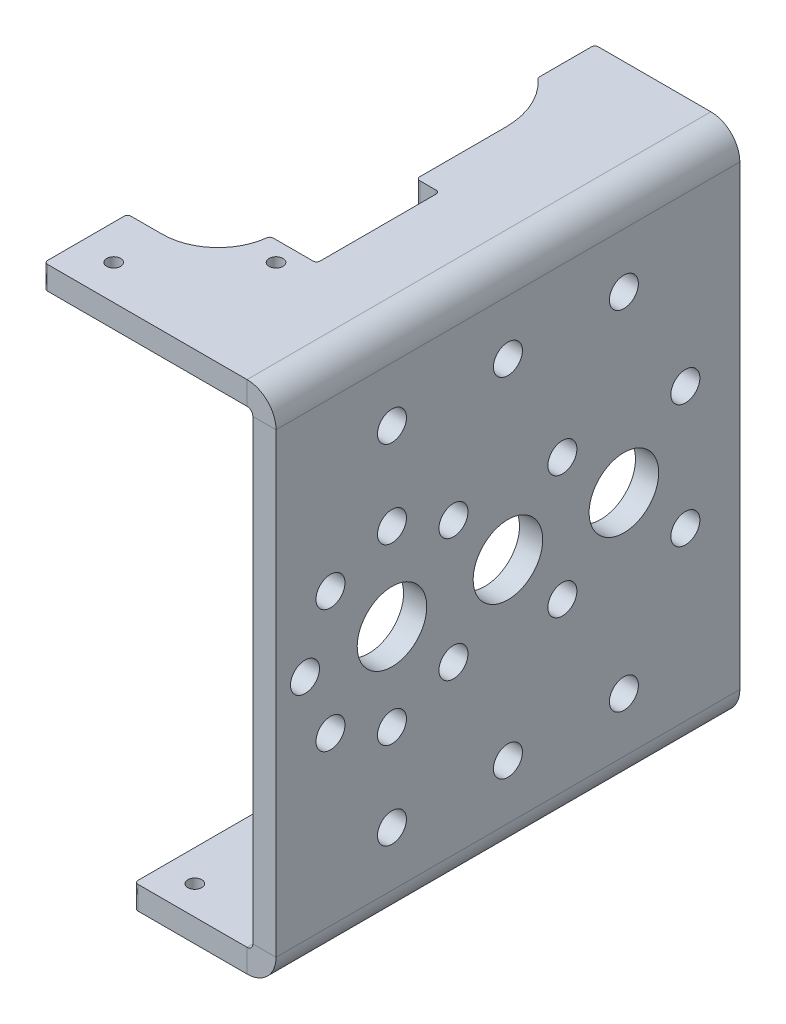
ISO-10303-21;
HEADER;
FILE_DESCRIPTION(('STEP AP214'),'2;1');
FILE_NAME('part.step','',(''),(''),'','','');
FILE_SCHEMA(('AUTOMOTIVE_DESIGN { 1 0 10303 214 1 1 1 1 }'));
ENDSEC;
DATA;
#1=APPLICATION_CONTEXT('core data for automotive mechanical design processes');
#2=APPLICATION_PROTOCOL_DEFINITION('international standard','automotive_design',2000,#1);
#3=PRODUCT_CONTEXT('',#1,'mechanical');
#4=PRODUCT('Part','Part','',(#3));
#5=PRODUCT_RELATED_PRODUCT_CATEGORY('part','',(#4));
#6=PRODUCT_DEFINITION_FORMATION('','',#4);
#7=PRODUCT_DEFINITION_CONTEXT('part definition',#1,'design');
#8=PRODUCT_DEFINITION('design','',#6,#7);
#9=PRODUCT_DEFINITION_SHAPE('','',#8);
#10=(LENGTH_UNIT() NAMED_UNIT(*) SI_UNIT(.MILLI.,.METRE.));
#11=(NAMED_UNIT(*) PLANE_ANGLE_UNIT() SI_UNIT($,.RADIAN.));
#12=(NAMED_UNIT(*) SI_UNIT($,.STERADIAN.) SOLID_ANGLE_UNIT());
#13=UNCERTAINTY_MEASURE_WITH_UNIT(LENGTH_MEASURE(1.E-05),#10,'distance_accuracy_value','');
#14=(GEOMETRIC_REPRESENTATION_CONTEXT(3) GLOBAL_UNCERTAINTY_ASSIGNED_CONTEXT((#13)) GLOBAL_UNIT_ASSIGNED_CONTEXT((#10,
#11,#12)) REPRESENTATION_CONTEXT('',''));
#15=CARTESIAN_POINT('',(0.,0.,0.));
#16=DIRECTION('',(0.,0.,1.));
#17=DIRECTION('',(1.,0.,0.));
#18=AXIS2_PLACEMENT_3D('',#15,#16,#17);
#19=CARTESIAN_POINT('',(14.5,20.2,0.));
#20=DIRECTION('',(0.,0.,1.));
#21=DIRECTION('',(1.,0.,0.));
#22=AXIS2_PLACEMENT_3D('',#19,#20,#21);
#23=PLANE('',#22);
#24=DIRECTION('',(0.,1.,0.));
#25=VECTOR('',#24,1.);
#26=CARTESIAN_POINT('',(14.5,20.2,0.));
#27=LINE('',#26,#25);
#28=CARTESIAN_POINT('',(14.5,20.2,0.));
#29=VERTEX_POINT('',#28);
#30=CARTESIAN_POINT('',(14.5,22.2,0.));
#31=VERTEX_POINT('',#30);
#32=EDGE_CURVE('E463',#29,#31,#27,.T.);
#33=ORIENTED_EDGE('',*,*,#32,.F.);
#34=CARTESIAN_POINT('',(14.5,19.7,0.));
#35=DIRECTION('',(0.,0.,1.));
#36=DIRECTION('',(1.,0.,0.));
#37=AXIS2_PLACEMENT_3D('',#34,#35,#36);
#38=CIRCLE('',#37,0.5);
#39=CARTESIAN_POINT('',(15.,19.7,0.));
#40=VERTEX_POINT('',#39);
#41=EDGE_CURVE('E419',#29,#40,#38,.F.);
#42=ORIENTED_EDGE('',*,*,#41,.T.);
#43=DIRECTION('',(-1.,0.,0.));
#44=VECTOR('',#43,1.);
#45=CARTESIAN_POINT('',(17.,19.7,0.));
#46=LINE('',#45,#44);
#47=CARTESIAN_POINT('',(17.,19.7,0.));
#48=VERTEX_POINT('',#47);
#49=EDGE_CURVE('E461',#48,#40,#46,.T.);
#50=ORIENTED_EDGE('',*,*,#49,.F.);
#51=CARTESIAN_POINT('',(14.5,19.7,0.));
#52=DIRECTION('',(0.,0.,1.));
#53=DIRECTION('',(1.,0.,0.));
#54=AXIS2_PLACEMENT_3D('',#51,#52,#53);
#55=CIRCLE('',#54,2.5);
#56=EDGE_CURVE('E412',#31,#48,#55,.F.);
#57=ORIENTED_EDGE('',*,*,#56,.F.);
#58=EDGE_LOOP('',(#33,#42,#50,#57));
#59=FACE_BOUND('',#58,.T.);
#60=ADVANCED_FACE('F40',(#59),#23,.T.);
#61=CARTESIAN_POINT('',(17.,19.7,0.));
#62=DIRECTION('',(0.,0.,1.));
#63=DIRECTION('',(1.,0.,0.));
#64=AXIS2_PLACEMENT_3D('',#61,#62,#63);
#65=PLANE('',#64);
#66=DIRECTION('',(1.,0.,0.));
#67=VECTOR('',#66,1.);
#68=CARTESIAN_POINT('',(-3.,22.2,0.));
#69=LINE('',#68,#67);
#70=CARTESIAN_POINT('',(-2.7,22.2,0.));
#71=VERTEX_POINT('',#70);
#72=EDGE_CURVE('E415',#71,#31,#69,.T.);
#73=ORIENTED_EDGE('',*,*,#72,.F.);
#74=DIRECTION('',(0.,1.,0.));
#75=VECTOR('',#74,1.);
#76=CARTESIAN_POINT('',(-2.7,20.2,0.));
#77=LINE('',#76,#75);
#78=CARTESIAN_POINT('',(-2.7,20.2,0.));
#79=VERTEX_POINT('',#78);
#80=EDGE_CURVE('E555',#71,#79,#77,.F.);
#81=ORIENTED_EDGE('',*,*,#80,.T.);
#82=DIRECTION('',(1.,0.,0.));
#83=VECTOR('',#82,1.);
#84=CARTESIAN_POINT('',(-3.,20.2,0.));
#85=LINE('',#84,#83);
#86=EDGE_CURVE('E417',#79,#29,#85,.T.);
#87=ORIENTED_EDGE('',*,*,#86,.T.);
#88=ORIENTED_EDGE('',*,*,#32,.T.);
#89=EDGE_LOOP('',(#73,#81,#87,#88));
#90=FACE_BOUND('',#89,.T.);
#91=ADVANCED_FACE('F612',(#90),#65,.T.);
#92=CARTESIAN_POINT('',(15.,-19.7,0.));
#93=DIRECTION('',(0.,0.,1.));
#94=DIRECTION('',(1.,0.,0.));
#95=AXIS2_PLACEMENT_3D('',#92,#93,#94);
#96=PLANE('',#95);
#97=DIRECTION('',(1.,0.,0.));
#98=VECTOR('',#97,1.);
#99=CARTESIAN_POINT('',(15.,-19.7,0.));
#100=LINE('',#99,#98);
#101=CARTESIAN_POINT('',(15.,-19.7,0.));
#102=VERTEX_POINT('',#101);
#103=CARTESIAN_POINT('',(17.,-19.7,0.));
#104=VERTEX_POINT('',#103);
#105=EDGE_CURVE('E459',#102,#104,#100,.T.);
#106=ORIENTED_EDGE('',*,*,#105,.F.);
#107=CARTESIAN_POINT('',(14.5,-19.7,0.));
#108=DIRECTION('',(0.,0.,1.));
#109=DIRECTION('',(1.,0.,0.));
#110=AXIS2_PLACEMENT_3D('',#107,#108,#109);
#111=CIRCLE('',#110,0.5);
#112=CARTESIAN_POINT('',(14.5,-20.2,0.));
#113=VERTEX_POINT('',#112);
#114=EDGE_CURVE('E425',#102,#113,#111,.F.);
#115=ORIENTED_EDGE('',*,*,#114,.T.);
#116=DIRECTION('',(0.,1.,0.));
#117=VECTOR('',#116,1.);
#118=CARTESIAN_POINT('',(14.5,-22.2,0.));
#119=LINE('',#118,#117);
#120=CARTESIAN_POINT('',(14.5,-22.2,0.));
#121=VERTEX_POINT('',#120);
#122=EDGE_CURVE('E432',#121,#113,#119,.T.);
#123=ORIENTED_EDGE('',*,*,#122,.F.);
#124=CARTESIAN_POINT('',(14.5,-19.7,0.));
#125=DIRECTION('',(0.,0.,1.));
#126=DIRECTION('',(1.,0.,0.));
#127=AXIS2_PLACEMENT_3D('',#124,#125,#126);
#128=CIRCLE('',#127,2.5);
#129=EDGE_CURVE('E406',#104,#121,#128,.F.);
#130=ORIENTED_EDGE('',*,*,#129,.F.);
#131=EDGE_LOOP('',(#106,#115,#123,#130));
#132=FACE_BOUND('',#131,.T.);
#133=ADVANCED_FACE('F618',(#132),#96,.T.);
#134=CARTESIAN_POINT('',(14.5,-22.2,0.));
#135=DIRECTION('',(0.,0.,1.));
#136=DIRECTION('',(1.,0.,0.));
#137=AXIS2_PLACEMENT_3D('',#134,#135,#136);
#138=PLANE('',#137);
#139=DIRECTION('',(0.,-1.,0.));
#140=VECTOR('',#139,1.);
#141=CARTESIAN_POINT('',(15.,20.2,0.));
#142=LINE('',#141,#140);
#143=EDGE_CURVE('E422',#40,#102,#142,.T.);
#144=ORIENTED_EDGE('',*,*,#143,.T.);
#145=ORIENTED_EDGE('',*,*,#105,.T.);
#146=DIRECTION('',(0.,-1.,0.));
#147=VECTOR('',#146,1.);
#148=CARTESIAN_POINT('',(17.,20.2,0.));
#149=LINE('',#148,#147);
#150=EDGE_CURVE('E409',#48,#104,#149,.T.);
#151=ORIENTED_EDGE('',*,*,#150,.F.);
#152=ORIENTED_EDGE('',*,*,#49,.T.);
#153=EDGE_LOOP('',(#144,#145,#151,#152));
#154=FACE_BOUND('',#153,.T.);
#155=ADVANCED_FACE('F1033',(#154),#138,.T.);
#156=CARTESIAN_POINT('',(15.,-20.2,-88.6966117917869));
#157=DIRECTION('',(0.,1.,0.));
#158=DIRECTION('',(-1.,0.,0.));
#159=AXIS2_PLACEMENT_3D('',#156,#157,#158);
#160=PLANE('',#159);
#161=CARTESIAN_POINT('',(7.5,-20.2,-18.));
#162=DIRECTION('',(0.,-1.,0.));
#163=DIRECTION('',(1.,0.,0.));
#164=AXIS2_PLACEMENT_3D('',#161,#162,#163);
#165=CIRCLE('',#164,0.599999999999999);
#166=CARTESIAN_POINT('',(8.1,-20.2,-18.));
#167=VERTEX_POINT('',#166);
#168=EDGE_CURVE('E742',#167,#167,#165,.T.);
#169=ORIENTED_EDGE('',*,*,#168,.T.);
#170=EDGE_LOOP('',(#169));
#171=FACE_BOUND('',#170,.T.);
#172=CARTESIAN_POINT('',(7.5,-20.2,-37.5));
#173=DIRECTION('',(0.,-1.,0.));
#174=DIRECTION('',(1.,0.,0.));
#175=AXIS2_PLACEMENT_3D('',#172,#173,#174);
#176=CIRCLE('',#175,0.6);
#177=CARTESIAN_POINT('',(8.1,-20.2,-37.5));
#178=VERTEX_POINT('',#177);
#179=EDGE_CURVE('E745',#178,#178,#176,.T.);
#180=ORIENTED_EDGE('',*,*,#179,.T.);
#181=EDGE_LOOP('',(#180));
#182=FACE_BOUND('',#181,.T.);
#183=CARTESIAN_POINT('',(7.5,-20.2,-2.5));
#184=DIRECTION('',(0.,-1.,0.));
#185=DIRECTION('',(1.,0.,0.));
#186=AXIS2_PLACEMENT_3D('',#183,#184,#185);
#187=CIRCLE('',#186,0.599999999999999);
#188=CARTESIAN_POINT('',(8.1,-20.2,-2.5));
#189=VERTEX_POINT('',#188);
#190=EDGE_CURVE('E722',#189,#189,#187,.T.);
#191=ORIENTED_EDGE('',*,*,#190,.T.);
#192=EDGE_LOOP('',(#191));
#193=FACE_BOUND('',#192,.T.);
#194=DIRECTION('',(0.,0.,1.));
#195=VECTOR('',#194,1.);
#196=CARTESIAN_POINT('',(5.00000000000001,-20.2,-34.6086874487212));
#197=LINE('',#196,#195);
#198=CARTESIAN_POINT('',(5.00000000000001,-20.2,-39.7));
#199=VERTEX_POINT('',#198);
#200=CARTESIAN_POINT('',(5.00000000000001,-20.2,-34.7244047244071));
#201=VERTEX_POINT('',#200);
#202=EDGE_CURVE('E706',#199,#201,#197,.T.);
#203=ORIENTED_EDGE('',*,*,#202,.T.);
#204=CARTESIAN_POINT('',(5.30000000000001,-20.2,-34.7244047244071));
#205=DIRECTION('',(0.,1.,0.));
#206=DIRECTION('',(-1.,0.,0.));
#207=AXIS2_PLACEMENT_3D('',#204,#205,#206);
#208=CIRCLE('',#207,0.3);
#209=CARTESIAN_POINT('',(5.07605633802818,-20.2,-34.524781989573));
#210=VERTEX_POINT('',#209);
#211=EDGE_CURVE('E494',#201,#210,#208,.T.);
#212=ORIENTED_EDGE('',*,*,#211,.T.);
#213=CARTESIAN_POINT('',(0.,-20.2,-30.));
#214=DIRECTION('',(0.,-1.,0.));
#215=DIRECTION('',(-1.,0.,0.));
#216=AXIS2_PLACEMENT_3D('',#213,#214,#215);
#217=CIRCLE('',#216,6.80000000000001);
#218=CARTESIAN_POINT('',(6.36451180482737,-20.2,-27.6056338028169));
#219=VERTEX_POINT('',#218);
#220=EDGE_CURVE('E734',#210,#219,#217,.T.);
#221=ORIENTED_EDGE('',*,*,#220,.T.);
#222=CARTESIAN_POINT('',(6.64529909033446,-20.2,-27.5));
#223=DIRECTION('',(0.,1.,0.));
#224=DIRECTION('',(-1.,0.,0.));
#225=AXIS2_PLACEMENT_3D('',#222,#223,#224);
#226=CIRCLE('',#225,0.3);
#227=CARTESIAN_POINT('',(6.64529909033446,-20.2,-27.2));
#228=VERTEX_POINT('',#227);
#229=EDGE_CURVE('E492',#219,#228,#226,.T.);
#230=ORIENTED_EDGE('',*,*,#229,.T.);
#231=DIRECTION('',(1.,0.,0.));
#232=VECTOR('',#231,1.);
#233=CARTESIAN_POINT('',(8.8,-20.2,-27.2));
#234=LINE('',#233,#232);
#235=CARTESIAN_POINT('',(8.5,-20.2,-27.2));
#236=VERTEX_POINT('',#235);
#237=EDGE_CURVE('E731',#228,#236,#234,.T.);
#238=ORIENTED_EDGE('',*,*,#237,.T.);
#239=CARTESIAN_POINT('',(8.5,-20.2,-26.9));
#240=DIRECTION('',(0.,1.,0.));
#241=DIRECTION('',(-1.,0.,0.));
#242=AXIS2_PLACEMENT_3D('',#239,#240,#241);
#243=CIRCLE('',#242,0.3);
#244=CARTESIAN_POINT('',(8.8,-20.2,-26.9));
#245=VERTEX_POINT('',#244);
#246=EDGE_CURVE('E582',#236,#245,#243,.F.);
#247=ORIENTED_EDGE('',*,*,#246,.T.);
#248=DIRECTION('',(0.,0.,1.));
#249=VECTOR('',#248,1.);
#250=CARTESIAN_POINT('',(8.8,-20.2,-19.2));
#251=LINE('',#250,#249);
#252=CARTESIAN_POINT('',(8.8,-20.2,-19.5));
#253=VERTEX_POINT('',#252);
#254=EDGE_CURVE('E728',#245,#253,#251,.T.);
#255=ORIENTED_EDGE('',*,*,#254,.T.);
#256=CARTESIAN_POINT('',(8.5,-20.2,-19.5));
#257=DIRECTION('',(0.,1.,0.));
#258=DIRECTION('',(-1.,0.,0.));
#259=AXIS2_PLACEMENT_3D('',#256,#257,#258);
#260=CIRCLE('',#259,0.3);
#261=CARTESIAN_POINT('',(8.5,-20.2,-19.2));
#262=VERTEX_POINT('',#261);
#263=EDGE_CURVE('E586',#253,#262,#260,.F.);
#264=ORIENTED_EDGE('',*,*,#263,.T.);
#265=DIRECTION('',(-1.,0.,0.));
#266=VECTOR('',#265,1.);
#267=CARTESIAN_POINT('',(4.8,-20.2,-19.2));
#268=LINE('',#267,#266);
#269=CARTESIAN_POINT('',(5.1,-20.2,-19.2));
#270=VERTEX_POINT('',#269);
#271=EDGE_CURVE('E725',#262,#270,#268,.T.);
#272=ORIENTED_EDGE('',*,*,#271,.T.);
#273=CARTESIAN_POINT('',(5.1,-20.2,-18.9));
#274=DIRECTION('',(0.,1.,0.));
#275=DIRECTION('',(-1.,0.,0.));
#276=AXIS2_PLACEMENT_3D('',#273,#274,#275);
#277=CIRCLE('',#276,0.3);
#278=CARTESIAN_POINT('',(4.8,-20.2,-18.9));
#279=VERTEX_POINT('',#278);
#280=EDGE_CURVE('E490',#270,#279,#277,.T.);
#281=ORIENTED_EDGE('',*,*,#280,.T.);
#282=DIRECTION('',(0.,0.,1.));
#283=VECTOR('',#282,1.);
#284=CARTESIAN_POINT('',(4.8,-20.2,0.));
#285=LINE('',#284,#283);
#286=CARTESIAN_POINT('',(4.8,-20.2,-0.3));
#287=VERTEX_POINT('',#286);
#288=EDGE_CURVE('E343',#279,#287,#285,.T.);
#289=ORIENTED_EDGE('',*,*,#288,.T.);
#290=CARTESIAN_POINT('',(5.1,-20.2,-0.3));
#291=DIRECTION('',(0.,1.,0.));
#292=DIRECTION('',(-1.,0.,0.));
#293=AXIS2_PLACEMENT_3D('',#290,#291,#292);
#294=CIRCLE('',#293,0.3);
#295=CARTESIAN_POINT('',(5.1,-20.2,0.));
#296=VERTEX_POINT('',#295);
#297=EDGE_CURVE('E488',#287,#296,#294,.T.);
#298=ORIENTED_EDGE('',*,*,#297,.T.);
#299=DIRECTION('',(-1.,0.,0.));
#300=VECTOR('',#299,1.);
#301=CARTESIAN_POINT('',(15.,-20.2,0.));
#302=LINE('',#301,#300);
#303=EDGE_CURVE('E400',#113,#296,#302,.T.);
#304=ORIENTED_EDGE('',*,*,#303,.F.);
#305=DIRECTION('',(0.,0.,1.));
#306=VECTOR('',#305,1.);
#307=CARTESIAN_POINT('',(14.5,-20.2,-88.6966117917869));
#308=LINE('',#307,#306);
#309=CARTESIAN_POINT('',(14.5,-20.2,-40.));
#310=VERTEX_POINT('',#309);
#311=EDGE_CURVE('E429',#310,#113,#308,.T.);
#312=ORIENTED_EDGE('',*,*,#311,.F.);
#313=DIRECTION('',(1.,0.,0.));
#314=VECTOR('',#313,1.);
#315=CARTESIAN_POINT('',(15.,-20.2,-40.));
#316=LINE('',#315,#314);
#317=CARTESIAN_POINT('',(5.30000000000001,-20.2,-40.));
#318=VERTEX_POINT('',#317);
#319=EDGE_CURVE('E384',#318,#310,#316,.T.);
#320=ORIENTED_EDGE('',*,*,#319,.F.);
#321=CARTESIAN_POINT('',(5.30000000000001,-20.2,-39.7));
#322=DIRECTION('',(0.,1.,0.));
#323=DIRECTION('',(-1.,0.,0.));
#324=AXIS2_PLACEMENT_3D('',#321,#322,#323);
#325=CIRCLE('',#324,0.3);
#326=EDGE_CURVE('E486',#318,#199,#325,.T.);
#327=ORIENTED_EDGE('',*,*,#326,.T.);
#328=EDGE_LOOP('',(#203,#212,#221,#230,#238,#247,#255,#264,#272,#281,#289,#298,#304,#312,#320,#327));
#329=FACE_BOUND('',#328,.T.);
#330=ADVANCED_FACE('F980',(#171,#182,#193,#329),#160,.T.);
#331=CARTESIAN_POINT('',(14.5,-19.7,-88.6966117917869));
#332=DIRECTION('',(0.,0.,1.));
#333=DIRECTION('',(1.,0.,0.));
#334=AXIS2_PLACEMENT_3D('',#331,#332,#333);
#335=CYLINDRICAL_SURFACE('',#334,0.5);
#336=DIRECTION('',(0.,0.,1.));
#337=VECTOR('',#336,1.);
#338=CARTESIAN_POINT('',(15.,-19.7,-88.6966117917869));
#339=LINE('',#338,#337);
#340=CARTESIAN_POINT('',(15.,-19.7,-40.));
#341=VERTEX_POINT('',#340);
#342=EDGE_CURVE('E433',#341,#102,#339,.T.);
#343=ORIENTED_EDGE('',*,*,#342,.F.);
#344=CARTESIAN_POINT('',(14.5,-19.7,-40.));
#345=DIRECTION('',(0.,0.,-1.));
#346=DIRECTION('',(-1.,0.,0.));
#347=AXIS2_PLACEMENT_3D('',#344,#345,#346);
#348=CIRCLE('',#347,0.5);
#349=EDGE_CURVE('E367',#310,#341,#348,.F.);
#350=ORIENTED_EDGE('',*,*,#349,.F.);
#351=ORIENTED_EDGE('',*,*,#311,.T.);
#352=ORIENTED_EDGE('',*,*,#114,.F.);
#353=EDGE_LOOP('',(#343,#350,#351,#352));
#354=FACE_BOUND('',#353,.T.);
#355=ADVANCED_FACE('F901',(#354),#335,.F.);
#356=CARTESIAN_POINT('',(15.,20.2,-88.6966117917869));
#357=DIRECTION('',(-1.,0.,0.));
#358=DIRECTION('',(0.,-1.,0.));
#359=AXIS2_PLACEMENT_3D('',#356,#357,#358);
#360=PLANE('',#359);
#361=CARTESIAN_POINT('',(15.,-15.,-10.));
#362=DIRECTION('',(-1.,0.,0.));
#363=DIRECTION('',(0.,-1.,0.));
#364=AXIS2_PLACEMENT_3D('',#361,#362,#363);
#365=CIRCLE('',#364,1.25);
#366=CARTESIAN_POINT('',(15.,-16.25,-10.));
#367=VERTEX_POINT('',#366);
#368=EDGE_CURVE('E838',#367,#367,#365,.T.);
#369=ORIENTED_EDGE('',*,*,#368,.F.);
#370=EDGE_LOOP('',(#369));
#371=FACE_BOUND('',#370,.T.);
#372=CARTESIAN_POINT('',(15.,0.,-30.));
#373=DIRECTION('',(-1.,0.,0.));
#374=DIRECTION('',(0.,1.,0.));
#375=AXIS2_PLACEMENT_3D('',#372,#373,#374);
#376=CIRCLE('',#375,3.);
#377=CARTESIAN_POINT('',(15.,3.,-30.));
#378=VERTEX_POINT('',#377);
#379=EDGE_CURVE('E845',#378,#378,#376,.T.);
#380=ORIENTED_EDGE('',*,*,#379,.F.);
#381=EDGE_LOOP('',(#380));
#382=FACE_BOUND('',#381,.T.);
#383=CARTESIAN_POINT('',(15.,-5.30330085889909,-35.3033008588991));
#384=DIRECTION('',(-1.,0.,0.));
#385=DIRECTION('',(0.,1.,0.));
#386=AXIS2_PLACEMENT_3D('',#383,#384,#385);
#387=CIRCLE('',#386,1.25);
#388=CARTESIAN_POINT('',(15.,-4.0533008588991,-35.3033008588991));
#389=VERTEX_POINT('',#388);
#390=EDGE_CURVE('E851',#389,#389,#387,.T.);
#391=ORIENTED_EDGE('',*,*,#390,.F.);
#392=EDGE_LOOP('',(#391));
#393=FACE_BOUND('',#392,.T.);
#394=CARTESIAN_POINT('',(15.,-5.30330085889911,-24.6966991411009));
#395=DIRECTION('',(-1.,0.,0.));
#396=DIRECTION('',(0.,1.,0.));
#397=AXIS2_PLACEMENT_3D('',#394,#395,#396);
#398=CIRCLE('',#397,1.25);
#399=CARTESIAN_POINT('',(15.,-4.05330085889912,-24.6966991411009));
#400=VERTEX_POINT('',#399);
#401=EDGE_CURVE('E826',#400,#400,#398,.T.);
#402=ORIENTED_EDGE('',*,*,#401,.F.);
#403=EDGE_LOOP('',(#402));
#404=FACE_BOUND('',#403,.T.);
#405=CARTESIAN_POINT('',(15.,5.3033008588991,-24.6966991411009));
#406=DIRECTION('',(-1.,0.,0.));
#407=DIRECTION('',(0.,1.,0.));
#408=AXIS2_PLACEMENT_3D('',#405,#406,#407);
#409=CIRCLE('',#408,1.25);
#410=CARTESIAN_POINT('',(15.,6.5533008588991,-24.6966991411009));
#411=VERTEX_POINT('',#410);
#412=EDGE_CURVE('E833',#411,#411,#409,.T.);
#413=ORIENTED_EDGE('',*,*,#412,.F.);
#414=EDGE_LOOP('',(#413));
#415=FACE_BOUND('',#414,.T.);
#416=CARTESIAN_POINT('',(15.,-15.,-20.));
#417=DIRECTION('',(-1.,0.,0.));
#418=DIRECTION('',(0.,-1.,0.));
#419=AXIS2_PLACEMENT_3D('',#416,#417,#418);
#420=CIRCLE('',#419,1.25);
#421=CARTESIAN_POINT('',(15.,-16.25,-20.));
#422=VERTEX_POINT('',#421);
#423=EDGE_CURVE('E880',#422,#422,#420,.T.);
#424=ORIENTED_EDGE('',*,*,#423,.F.);
#425=EDGE_LOOP('',(#424));
#426=FACE_BOUND('',#425,.T.);
#427=CARTESIAN_POINT('',(15.,-15.,-30.));
#428=DIRECTION('',(-1.,0.,0.));
#429=DIRECTION('',(0.,1.,0.));
#430=AXIS2_PLACEMENT_3D('',#427,#428,#429);
#431=CIRCLE('',#430,1.25);
#432=CARTESIAN_POINT('',(15.,-13.75,-30.));
#433=VERTEX_POINT('',#432);
#434=EDGE_CURVE('E874',#433,#433,#431,.T.);
#435=ORIENTED_EDGE('',*,*,#434,.F.);
#436=EDGE_LOOP('',(#435));
#437=FACE_BOUND('',#436,.T.);
#438=CARTESIAN_POINT('',(15.,15.,-30.));
#439=DIRECTION('',(-1.,0.,0.));
#440=DIRECTION('',(0.,-1.,0.));
#441=AXIS2_PLACEMENT_3D('',#438,#439,#440);
#442=CIRCLE('',#441,1.25);
#443=CARTESIAN_POINT('',(15.,13.75,-30.));
#444=VERTEX_POINT('',#443);
#445=EDGE_CURVE('E868',#444,#444,#442,.T.);
#446=ORIENTED_EDGE('',*,*,#445,.F.);
#447=EDGE_LOOP('',(#446));
#448=FACE_BOUND('',#447,.T.);
#449=CARTESIAN_POINT('',(15.,15.,-20.));
#450=DIRECTION('',(-1.,0.,0.));
#451=DIRECTION('',(0.,1.,0.));
#452=AXIS2_PLACEMENT_3D('',#449,#450,#451);
#453=CIRCLE('',#452,1.25);
#454=CARTESIAN_POINT('',(15.,16.25,-20.));
#455=VERTEX_POINT('',#454);
#456=EDGE_CURVE('E862',#455,#455,#453,.T.);
#457=ORIENTED_EDGE('',*,*,#456,.F.);
#458=EDGE_LOOP('',(#457));
#459=FACE_BOUND('',#458,.T.);
#460=CARTESIAN_POINT('',(15.,15.,-10.));
#461=DIRECTION('',(-1.,0.,0.));
#462=DIRECTION('',(0.,1.,0.));
#463=AXIS2_PLACEMENT_3D('',#460,#461,#462);
#464=CIRCLE('',#463,1.25);
#465=CARTESIAN_POINT('',(15.,16.25,-10.));
#466=VERTEX_POINT('',#465);
#467=EDGE_CURVE('E856',#466,#466,#464,.T.);
#468=ORIENTED_EDGE('',*,*,#467,.F.);
#469=EDGE_LOOP('',(#468));
#470=FACE_BOUND('',#469,.T.);
#471=CARTESIAN_POINT('',(15.,0.,-10.));
#472=DIRECTION('',(-1.,0.,0.));
#473=DIRECTION('',(0.,-1.,0.));
#474=AXIS2_PLACEMENT_3D('',#471,#472,#473);
#475=CIRCLE('',#474,3.);
#476=CARTESIAN_POINT('',(15.,-3.,-10.));
#477=VERTEX_POINT('',#476);
#478=EDGE_CURVE('E791',#477,#477,#475,.T.);
#479=ORIENTED_EDGE('',*,*,#478,.F.);
#480=EDGE_LOOP('',(#479));
#481=FACE_BOUND('',#480,.T.);
#482=CARTESIAN_POINT('',(15.,-5.30330085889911,-15.3033008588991));
#483=DIRECTION('',(-1.,0.,0.));
#484=DIRECTION('',(0.,-1.,0.));
#485=AXIS2_PLACEMENT_3D('',#482,#483,#484);
#486=CIRCLE('',#485,1.25);
#487=CARTESIAN_POINT('',(15.,-6.55330085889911,-15.3033008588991));
#488=VERTEX_POINT('',#487);
#489=EDGE_CURVE('E785',#488,#488,#486,.T.);
#490=ORIENTED_EDGE('',*,*,#489,.F.);
#491=EDGE_LOOP('',(#490));
#492=FACE_BOUND('',#491,.T.);
#493=CARTESIAN_POINT('',(15.,5.30330085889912,-35.3033008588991));
#494=DIRECTION('',(-1.,0.,0.));
#495=DIRECTION('',(0.,1.,0.));
#496=AXIS2_PLACEMENT_3D('',#493,#494,#495);
#497=CIRCLE('',#496,1.24999999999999);
#498=CARTESIAN_POINT('',(15.,6.55330085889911,-35.3033008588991));
#499=VERTEX_POINT('',#498);
#500=EDGE_CURVE('E779',#499,#499,#497,.T.);
#501=ORIENTED_EDGE('',*,*,#500,.F.);
#502=EDGE_LOOP('',(#501));
#503=FACE_BOUND('',#502,.T.);
#504=CARTESIAN_POINT('',(15.,5.3033008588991,-15.3033008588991));
#505=DIRECTION('',(-1.,0.,0.));
#506=DIRECTION('',(0.,-1.,0.));
#507=AXIS2_PLACEMENT_3D('',#504,#505,#506);
#508=CIRCLE('',#507,1.25);
#509=CARTESIAN_POINT('',(15.,4.0533008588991,-15.3033008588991));
#510=VERTEX_POINT('',#509);
#511=EDGE_CURVE('E772',#510,#510,#508,.T.);
#512=ORIENTED_EDGE('',*,*,#511,.F.);
#513=EDGE_LOOP('',(#512));
#514=FACE_BOUND('',#513,.T.);
#515=CARTESIAN_POINT('',(15.,7.5,-10.));
#516=DIRECTION('',(-1.,0.,0.));
#517=DIRECTION('',(0.,-1.,0.));
#518=AXIS2_PLACEMENT_3D('',#515,#516,#517);
#519=CIRCLE('',#518,1.25);
#520=CARTESIAN_POINT('',(15.,6.25,-10.));
#521=VERTEX_POINT('',#520);
#522=EDGE_CURVE('E821',#521,#521,#519,.T.);
#523=ORIENTED_EDGE('',*,*,#522,.F.);
#524=EDGE_LOOP('',(#523));
#525=FACE_BOUND('',#524,.T.);
#526=CARTESIAN_POINT('',(15.,5.30330085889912,-4.6966991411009));
#527=DIRECTION('',(-1.,0.,0.));
#528=DIRECTION('',(0.,-1.,0.));
#529=AXIS2_PLACEMENT_3D('',#526,#527,#528);
#530=CIRCLE('',#529,1.25);
#531=CARTESIAN_POINT('',(15.,4.05330085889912,-4.6966991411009));
#532=VERTEX_POINT('',#531);
#533=EDGE_CURVE('E815',#532,#532,#530,.T.);
#534=ORIENTED_EDGE('',*,*,#533,.F.);
#535=EDGE_LOOP('',(#534));
#536=FACE_BOUND('',#535,.T.);
#537=CARTESIAN_POINT('',(15.,0.,-2.5));
#538=DIRECTION('',(-1.,0.,0.));
#539=DIRECTION('',(0.,-1.,0.));
#540=AXIS2_PLACEMENT_3D('',#537,#538,#539);
#541=CIRCLE('',#540,1.25);
#542=CARTESIAN_POINT('',(15.,-1.24999999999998,-2.5));
#543=VERTEX_POINT('',#542);
#544=EDGE_CURVE('E809',#543,#543,#541,.T.);
#545=ORIENTED_EDGE('',*,*,#544,.F.);
#546=EDGE_LOOP('',(#545));
#547=FACE_BOUND('',#546,.T.);
#548=CARTESIAN_POINT('',(15.,-5.30330085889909,-4.69669914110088));
#549=DIRECTION('',(-1.,0.,0.));
#550=DIRECTION('',(0.,-1.,0.));
#551=AXIS2_PLACEMENT_3D('',#548,#549,#550);
#552=CIRCLE('',#551,1.25);
#553=CARTESIAN_POINT('',(15.,-6.55330085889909,-4.69669914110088));
#554=VERTEX_POINT('',#553);
#555=EDGE_CURVE('E803',#554,#554,#552,.T.);
#556=ORIENTED_EDGE('',*,*,#555,.F.);
#557=EDGE_LOOP('',(#556));
#558=FACE_BOUND('',#557,.T.);
#559=CARTESIAN_POINT('',(15.,-7.5,-9.99999999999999));
#560=DIRECTION('',(-1.,0.,0.));
#561=DIRECTION('',(0.,-1.,0.));
#562=AXIS2_PLACEMENT_3D('',#559,#560,#561);
#563=CIRCLE('',#562,1.25);
#564=CARTESIAN_POINT('',(15.,-8.75,-9.99999999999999));
#565=VERTEX_POINT('',#564);
#566=EDGE_CURVE('E796',#565,#565,#563,.T.);
#567=ORIENTED_EDGE('',*,*,#566,.F.);
#568=EDGE_LOOP('',(#567));
#569=FACE_BOUND('',#568,.T.);
#570=CARTESIAN_POINT('',(15.,0.,-20.));
#571=DIRECTION('',(-1.,0.,0.));
#572=DIRECTION('',(0.,-1.,0.));
#573=AXIS2_PLACEMENT_3D('',#570,#571,#572);
#574=CIRCLE('',#573,3.);
#575=CARTESIAN_POINT('',(15.,-3.,-20.));
#576=VERTEX_POINT('',#575);
#577=EDGE_CURVE('E766',#576,#576,#574,.T.);
#578=ORIENTED_EDGE('',*,*,#577,.F.);
#579=EDGE_LOOP('',(#578));
#580=FACE_BOUND('',#579,.T.);
#581=DIRECTION('',(0.,0.,1.));
#582=VECTOR('',#581,1.);
#583=CARTESIAN_POINT('',(15.,19.7,-88.6966117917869));
#584=LINE('',#583,#582);
#585=CARTESIAN_POINT('',(15.,19.7,-40.));
#586=VERTEX_POINT('',#585);
#587=EDGE_CURVE('E436',#586,#40,#584,.T.);
#588=ORIENTED_EDGE('',*,*,#587,.F.);
#589=DIRECTION('',(0.,-1.,0.));
#590=VECTOR('',#589,1.);
#591=CARTESIAN_POINT('',(15.,20.2,-40.));
#592=LINE('',#591,#590);
#593=EDGE_CURVE('E374',#341,#586,#592,.F.);
#594=ORIENTED_EDGE('',*,*,#593,.F.);
#595=ORIENTED_EDGE('',*,*,#342,.T.);
#596=ORIENTED_EDGE('',*,*,#143,.F.);
#597=EDGE_LOOP('',(#588,#594,#595,#596));
#598=FACE_BOUND('',#597,.T.);
#599=ADVANCED_FACE('F897',(#371,#382,#393,#404,#415,#426,#437,#448,#459,#470,#481,#492,#503,
#514,#525,#536,#547,#558,#569,#580,#598),#360,.T.);
#600=CARTESIAN_POINT('',(14.5,19.7,-88.6966117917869));
#601=DIRECTION('',(0.,0.,1.));
#602=DIRECTION('',(1.,0.,0.));
#603=AXIS2_PLACEMENT_3D('',#600,#601,#602);
#604=CYLINDRICAL_SURFACE('',#603,0.5);
#605=DIRECTION('',(0.,0.,1.));
#606=VECTOR('',#605,1.);
#607=CARTESIAN_POINT('',(14.5,20.2,-88.6966117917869));
#608=LINE('',#607,#606);
#609=CARTESIAN_POINT('',(14.5,20.2,-40.));
#610=VERTEX_POINT('',#609);
#611=EDGE_CURVE('E439',#610,#29,#608,.T.);
#612=ORIENTED_EDGE('',*,*,#611,.F.);
#613=CARTESIAN_POINT('',(14.5,19.7,-40.));
#614=DIRECTION('',(0.,0.,-1.));
#615=DIRECTION('',(-1.,0.,0.));
#616=AXIS2_PLACEMENT_3D('',#613,#614,#615);
#617=CIRCLE('',#616,0.5);
#618=EDGE_CURVE('E368',#586,#610,#617,.F.);
#619=ORIENTED_EDGE('',*,*,#618,.F.);
#620=ORIENTED_EDGE('',*,*,#587,.T.);
#621=ORIENTED_EDGE('',*,*,#41,.F.);
#622=EDGE_LOOP('',(#612,#619,#620,#621));
#623=FACE_BOUND('',#622,.T.);
#624=ADVANCED_FACE('F900',(#623),#604,.F.);
#625=CARTESIAN_POINT('',(-3.,20.2,-88.6966117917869));
#626=DIRECTION('',(0.,-1.,0.));
#627=DIRECTION('',(0.,0.,-1.));
#628=AXIS2_PLACEMENT_3D('',#625,#626,#627);
#629=PLANE('',#628);
#630=CARTESIAN_POINT('',(7.,20.2,-10.));
#631=DIRECTION('',(0.,1.,0.));
#632=DIRECTION('',(0.,0.,1.));
#633=AXIS2_PLACEMENT_3D('',#630,#631,#632);
#634=CIRCLE('',#633,0.6);
#635=CARTESIAN_POINT('',(7.,20.2,-9.40000000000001));
#636=VERTEX_POINT('',#635);
#637=EDGE_CURVE('E757',#636,#636,#634,.T.);
#638=ORIENTED_EDGE('',*,*,#637,.T.);
#639=EDGE_LOOP('',(#638));
#640=FACE_BOUND('',#639,.T.);
#641=CARTESIAN_POINT('',(0.,20.2,-3.));
#642=DIRECTION('',(0.,1.,0.));
#643=DIRECTION('',(0.,0.,1.));
#644=AXIS2_PLACEMENT_3D('',#641,#642,#643);
#645=CIRCLE('',#644,0.6);
#646=CARTESIAN_POINT('',(0.,20.2,-2.4));
#647=VERTEX_POINT('',#646);
#648=EDGE_CURVE('E749',#647,#647,#645,.T.);
#649=ORIENTED_EDGE('',*,*,#648,.T.);
#650=EDGE_LOOP('',(#649));
#651=FACE_BOUND('',#650,.T.);
#652=DIRECTION('',(0.,0.,-1.));
#653=VECTOR('',#652,1.);
#654=CARTESIAN_POINT('',(4.5,20.2,-35.0980388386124));
#655=LINE('',#654,#653);
#656=CARTESIAN_POINT('',(4.5,20.2,-35.2316345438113));
#657=VERTEX_POINT('',#656);
#658=CARTESIAN_POINT('',(4.5,20.2,-39.7));
#659=VERTEX_POINT('',#658);
#660=EDGE_CURVE('E310',#657,#659,#655,.T.);
#661=ORIENTED_EDGE('',*,*,#660,.T.);
#662=CARTESIAN_POINT('',(4.8,20.2,-39.7));
#663=DIRECTION('',(0.,-1.,0.));
#664=DIRECTION('',(0.,0.,-1.));
#665=AXIS2_PLACEMENT_3D('',#662,#663,#664);
#666=CIRCLE('',#665,0.3);
#667=CARTESIAN_POINT('',(4.8,20.2,-40.));
#668=VERTEX_POINT('',#667);
#669=EDGE_CURVE('E549',#659,#668,#666,.T.);
#670=ORIENTED_EDGE('',*,*,#669,.T.);
#671=DIRECTION('',(1.,0.,0.));
#672=VECTOR('',#671,1.);
#673=CARTESIAN_POINT('',(-3.,20.2,-40.));
#674=LINE('',#673,#672);
#675=EDGE_CURVE('E387',#610,#668,#674,.F.);
#676=ORIENTED_EDGE('',*,*,#675,.F.);
#677=ORIENTED_EDGE('',*,*,#611,.T.);
#678=ORIENTED_EDGE('',*,*,#86,.F.);
#679=CARTESIAN_POINT('',(-2.7,20.2,-0.299999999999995));
#680=DIRECTION('',(0.,-1.,0.));
#681=DIRECTION('',(0.,0.,-1.));
#682=AXIS2_PLACEMENT_3D('',#679,#680,#681);
#683=CIRCLE('',#682,0.3);
#684=CARTESIAN_POINT('',(-3.,20.2,-0.299999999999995));
#685=VERTEX_POINT('',#684);
#686=EDGE_CURVE('E55',#79,#685,#683,.T.);
#687=ORIENTED_EDGE('',*,*,#686,.T.);
#688=DIRECTION('',(0.,0.,1.));
#689=VECTOR('',#688,1.);
#690=CARTESIAN_POINT('',(-3.,20.2,-88.6966117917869));
#691=LINE('',#690,#689);
#692=CARTESIAN_POINT('',(-3.,20.2,-6.9));
#693=VERTEX_POINT('',#692);
#694=EDGE_CURVE('E442',#693,#685,#691,.T.);
#695=ORIENTED_EDGE('',*,*,#694,.F.);
#696=CARTESIAN_POINT('',(-2.7,20.2,-6.9));
#697=DIRECTION('',(0.,-1.,0.));
#698=DIRECTION('',(0.,0.,-1.));
#699=AXIS2_PLACEMENT_3D('',#696,#697,#698);
#700=CIRCLE('',#699,0.3);
#701=CARTESIAN_POINT('',(-2.7,20.2,-7.2));
#702=VERTEX_POINT('',#701);
#703=EDGE_CURVE('E306',#693,#702,#700,.T.);
#704=ORIENTED_EDGE('',*,*,#703,.T.);
#705=DIRECTION('',(1.,0.,0.));
#706=VECTOR('',#705,1.);
#707=CARTESIAN_POINT('',(0.,20.2,-7.2));
#708=LINE('',#707,#706);
#709=CARTESIAN_POINT('',(0.,20.2,-7.2));
#710=VERTEX_POINT('',#709);
#711=EDGE_CURVE('E298',#702,#710,#708,.T.);
#712=ORIENTED_EDGE('',*,*,#711,.T.);
#713=CARTESIAN_POINT('',(0.,20.2,-12.));
#714=DIRECTION('',(0.,1.,0.));
#715=DIRECTION('',(0.,0.,-1.));
#716=AXIS2_PLACEMENT_3D('',#713,#714,#715);
#717=CIRCLE('',#716,4.8);
#718=CARTESIAN_POINT('',(4.76666626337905,20.2,-11.4352941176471));
#719=VERTEX_POINT('',#718);
#720=EDGE_CURVE('E303',#710,#719,#717,.T.);
#721=ORIENTED_EDGE('',*,*,#720,.T.);
#722=CARTESIAN_POINT('',(5.06458290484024,20.2,-11.4));
#723=DIRECTION('',(0.,-1.,0.));
#724=DIRECTION('',(0.,0.,-1.));
#725=AXIS2_PLACEMENT_3D('',#722,#723,#724);
#726=CIRCLE('',#725,0.3);
#727=CARTESIAN_POINT('',(5.06458290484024,20.2,-11.7));
#728=VERTEX_POINT('',#727);
#729=EDGE_CURVE('E545',#719,#728,#726,.T.);
#730=ORIENTED_EDGE('',*,*,#729,.T.);
#731=DIRECTION('',(1.,0.,0.));
#732=VECTOR('',#731,1.);
#733=CARTESIAN_POINT('',(8.8,20.2,-11.7));
#734=LINE('',#733,#732);
#735=CARTESIAN_POINT('',(8.5,20.2,-11.7));
#736=VERTEX_POINT('',#735);
#737=EDGE_CURVE('E326',#728,#736,#734,.T.);
#738=ORIENTED_EDGE('',*,*,#737,.T.);
#739=CARTESIAN_POINT('',(8.5,20.2,-12.));
#740=DIRECTION('',(0.,-1.,0.));
#741=DIRECTION('',(0.,0.,-1.));
#742=AXIS2_PLACEMENT_3D('',#739,#740,#741);
#743=CIRCLE('',#742,0.3);
#744=CARTESIAN_POINT('',(8.8,20.2,-12.));
#745=VERTEX_POINT('',#744);
#746=EDGE_CURVE('E590',#736,#745,#743,.F.);
#747=ORIENTED_EDGE('',*,*,#746,.T.);
#748=DIRECTION('',(0.,0.,-1.));
#749=VECTOR('',#748,1.);
#750=CARTESIAN_POINT('',(8.8,20.2,-22.3));
#751=LINE('',#750,#749);
#752=CARTESIAN_POINT('',(8.8,20.2,-22.));
#753=VERTEX_POINT('',#752);
#754=EDGE_CURVE('E329',#745,#753,#751,.T.);
#755=ORIENTED_EDGE('',*,*,#754,.T.);
#756=CARTESIAN_POINT('',(8.5,20.2,-22.));
#757=DIRECTION('',(0.,-1.,0.));
#758=DIRECTION('',(0.,0.,-1.));
#759=AXIS2_PLACEMENT_3D('',#756,#757,#758);
#760=CIRCLE('',#759,0.3);
#761=CARTESIAN_POINT('',(8.5,20.2,-22.3));
#762=VERTEX_POINT('',#761);
#763=EDGE_CURVE('E594',#753,#762,#760,.F.);
#764=ORIENTED_EDGE('',*,*,#763,.T.);
#765=DIRECTION('',(-1.,0.,0.));
#766=VECTOR('',#765,1.);
#767=CARTESIAN_POINT('',(6.8,20.2,-22.3));
#768=LINE('',#767,#766);
#769=CARTESIAN_POINT('',(7.1,20.2,-22.3));
#770=VERTEX_POINT('',#769);
#771=EDGE_CURVE('E335',#762,#770,#768,.T.);
#772=ORIENTED_EDGE('',*,*,#771,.T.);
#773=CARTESIAN_POINT('',(7.1,20.2,-22.6));
#774=DIRECTION('',(0.,-1.,0.));
#775=DIRECTION('',(0.,0.,-1.));
#776=AXIS2_PLACEMENT_3D('',#773,#774,#775);
#777=CIRCLE('',#776,0.3);
#778=CARTESIAN_POINT('',(6.8,20.2,-22.6));
#779=VERTEX_POINT('',#778);
#780=EDGE_CURVE('E543',#770,#779,#777,.T.);
#781=ORIENTED_EDGE('',*,*,#780,.T.);
#782=DIRECTION('',(0.,0.,-1.));
#783=VECTOR('',#782,1.);
#784=CARTESIAN_POINT('',(6.8,20.2,-30.));
#785=LINE('',#784,#783);
#786=CARTESIAN_POINT('',(6.8,20.2,-30.));
#787=VERTEX_POINT('',#786);
#788=EDGE_CURVE('E321',#779,#787,#785,.T.);
#789=ORIENTED_EDGE('',*,*,#788,.T.);
#790=CARTESIAN_POINT('',(0.,20.2,-30.));
#791=DIRECTION('',(0.,1.,0.));
#792=DIRECTION('',(0.,0.,1.));
#793=AXIS2_PLACEMENT_3D('',#790,#791,#792);
#794=CIRCLE('',#793,6.8);
#795=CARTESIAN_POINT('',(4.59718309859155,20.2,-35.0105795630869));
#796=VERTEX_POINT('',#795);
#797=EDGE_CURVE('E360',#787,#796,#794,.T.);
#798=ORIENTED_EDGE('',*,*,#797,.T.);
#799=CARTESIAN_POINT('',(4.8,20.2,-35.2316345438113));
#800=DIRECTION('',(0.,-1.,0.));
#801=DIRECTION('',(0.,0.,-1.));
#802=AXIS2_PLACEMENT_3D('',#799,#800,#801);
#803=CIRCLE('',#802,0.3);
#804=EDGE_CURVE('E541',#796,#657,#803,.T.);
#805=ORIENTED_EDGE('',*,*,#804,.T.);
#806=EDGE_LOOP('',(#661,#670,#676,#677,#678,#687,#695,#704,#712,#721,#730,#738,#747,#755,#764,
#772,#781,#789,#798,#805));
#807=FACE_BOUND('',#806,.T.);
#808=ADVANCED_FACE('F301',(#640,#651,#807),#629,.T.);
#809=CARTESIAN_POINT('',(-3.,20.2,-88.6966117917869));
#810=DIRECTION('',(1.,0.,0.));
#811=DIRECTION('',(0.,0.,-1.));
#812=AXIS2_PLACEMENT_3D('',#809,#810,#811);
#813=PLANE('',#812);
#814=ORIENTED_EDGE('',*,*,#694,.T.);
#815=DIRECTION('',(0.,1.,0.));
#816=VECTOR('',#815,1.);
#817=CARTESIAN_POINT('',(-3.,22.2,-0.299999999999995));
#818=LINE('',#817,#816);
#819=CARTESIAN_POINT('',(-3.,22.2,-0.299999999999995));
#820=VERTEX_POINT('',#819);
#821=EDGE_CURVE('E552',#685,#820,#818,.T.);
#822=ORIENTED_EDGE('',*,*,#821,.T.);
#823=DIRECTION('',(0.,0.,1.));
#824=VECTOR('',#823,1.);
#825=CARTESIAN_POINT('',(-3.,22.2,-88.6966117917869));
#826=LINE('',#825,#824);
#827=CARTESIAN_POINT('',(-3.,22.2,-6.9));
#828=VERTEX_POINT('',#827);
#829=EDGE_CURVE('E444',#828,#820,#826,.T.);
#830=ORIENTED_EDGE('',*,*,#829,.F.);
#831=DIRECTION('',(0.,1.,0.));
#832=VECTOR('',#831,1.);
#833=CARTESIAN_POINT('',(-3.,20.2,-6.9));
#834=LINE('',#833,#832);
#835=EDGE_CURVE('E62',#828,#693,#834,.F.);
#836=ORIENTED_EDGE('',*,*,#835,.T.);
#837=EDGE_LOOP('',(#814,#822,#830,#836));
#838=FACE_BOUND('',#837,.T.);
#839=ADVANCED_FACE('F1055',(#838),#813,.F.);
#840=CARTESIAN_POINT('',(-3.,22.2,-88.6966117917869));
#841=DIRECTION('',(0.,-1.,0.));
#842=DIRECTION('',(0.,0.,-1.));
#843=AXIS2_PLACEMENT_3D('',#840,#841,#842);
#844=PLANE('',#843);
#845=CARTESIAN_POINT('',(7.,22.2,-10.));
#846=DIRECTION('',(0.,1.,0.));
#847=DIRECTION('',(0.,0.,1.));
#848=AXIS2_PLACEMENT_3D('',#845,#846,#847);
#849=CIRCLE('',#848,0.6);
#850=CARTESIAN_POINT('',(7.,22.2,-9.40000000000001));
#851=VERTEX_POINT('',#850);
#852=EDGE_CURVE('E760',#851,#851,#849,.T.);
#853=ORIENTED_EDGE('',*,*,#852,.F.);
#854=EDGE_LOOP('',(#853));
#855=FACE_BOUND('',#854,.T.);
#856=CARTESIAN_POINT('',(0.,22.2,-3.));
#857=DIRECTION('',(0.,1.,0.));
#858=DIRECTION('',(0.,0.,1.));
#859=AXIS2_PLACEMENT_3D('',#856,#857,#858);
#860=CIRCLE('',#859,0.6);
#861=CARTESIAN_POINT('',(0.,22.2,-2.4));
#862=VERTEX_POINT('',#861);
#863=EDGE_CURVE('E754',#862,#862,#860,.T.);
#864=ORIENTED_EDGE('',*,*,#863,.F.);
#865=EDGE_LOOP('',(#864));
#866=FACE_BOUND('',#865,.T.);
#867=DIRECTION('',(-1.,0.,0.));
#868=VECTOR('',#867,1.);
#869=CARTESIAN_POINT('',(-3.,22.2,-40.));
#870=LINE('',#869,#868);
#871=CARTESIAN_POINT('',(14.5,22.2,-40.));
#872=VERTEX_POINT('',#871);
#873=CARTESIAN_POINT('',(4.8,22.2,-40.));
#874=VERTEX_POINT('',#873);
#875=EDGE_CURVE('E370',#872,#874,#870,.T.);
#876=ORIENTED_EDGE('',*,*,#875,.T.);
#877=CARTESIAN_POINT('',(4.8,22.2,-39.7));
#878=DIRECTION('',(0.,-1.,0.));
#879=DIRECTION('',(0.,0.,-1.));
#880=AXIS2_PLACEMENT_3D('',#877,#878,#879);
#881=CIRCLE('',#880,0.3);
#882=CARTESIAN_POINT('',(4.5,22.2,-39.7));
#883=VERTEX_POINT('',#882);
#884=EDGE_CURVE('E534',#874,#883,#881,.F.);
#885=ORIENTED_EDGE('',*,*,#884,.T.);
#886=DIRECTION('',(0.,0.,-1.));
#887=VECTOR('',#886,1.);
#888=CARTESIAN_POINT('',(4.5,22.2,-35.0980388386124));
#889=LINE('',#888,#887);
#890=CARTESIAN_POINT('',(4.5,22.2,-35.2316345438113));
#891=VERTEX_POINT('',#890);
#892=EDGE_CURVE('E342',#891,#883,#889,.T.);
#893=ORIENTED_EDGE('',*,*,#892,.F.);
#894=CARTESIAN_POINT('',(4.8,22.2,-35.2316345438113));
#895=DIRECTION('',(0.,-1.,0.));
#896=DIRECTION('',(0.,0.,-1.));
#897=AXIS2_PLACEMENT_3D('',#894,#895,#896);
#898=CIRCLE('',#897,0.3);
#899=CARTESIAN_POINT('',(4.59718309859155,22.2,-35.0105795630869));
#900=VERTEX_POINT('',#899);
#901=EDGE_CURVE('E524',#891,#900,#898,.F.);
#902=ORIENTED_EDGE('',*,*,#901,.T.);
#903=CARTESIAN_POINT('',(0.,22.2,-30.));
#904=DIRECTION('',(0.,1.,0.));
#905=DIRECTION('',(0.,0.,1.));
#906=AXIS2_PLACEMENT_3D('',#903,#904,#905);
#907=CIRCLE('',#906,6.8);
#908=CARTESIAN_POINT('',(6.8,22.2,-30.));
#909=VERTEX_POINT('',#908);
#910=EDGE_CURVE('E339',#909,#900,#907,.T.);
#911=ORIENTED_EDGE('',*,*,#910,.F.);
#912=DIRECTION('',(0.,0.,-1.));
#913=VECTOR('',#912,1.);
#914=CARTESIAN_POINT('',(6.8,22.2,-30.));
#915=LINE('',#914,#913);
#916=CARTESIAN_POINT('',(6.8,22.2,-22.6));
#917=VERTEX_POINT('',#916);
#918=EDGE_CURVE('E358',#917,#909,#915,.T.);
#919=ORIENTED_EDGE('',*,*,#918,.F.);
#920=CARTESIAN_POINT('',(7.1,22.2,-22.6));
#921=DIRECTION('',(0.,-1.,0.));
#922=DIRECTION('',(0.,0.,-1.));
#923=AXIS2_PLACEMENT_3D('',#920,#921,#922);
#924=CIRCLE('',#923,0.3);
#925=CARTESIAN_POINT('',(7.1,22.2,-22.3));
#926=VERTEX_POINT('',#925);
#927=EDGE_CURVE('E526',#917,#926,#924,.F.);
#928=ORIENTED_EDGE('',*,*,#927,.T.);
#929=DIRECTION('',(-1.,0.,0.));
#930=VECTOR('',#929,1.);
#931=CARTESIAN_POINT('',(6.8,22.2,-22.3));
#932=LINE('',#931,#930);
#933=CARTESIAN_POINT('',(8.5,22.2,-22.3));
#934=VERTEX_POINT('',#933);
#935=EDGE_CURVE('E355',#934,#926,#932,.T.);
#936=ORIENTED_EDGE('',*,*,#935,.F.);
#937=CARTESIAN_POINT('',(8.5,22.2,-22.));
#938=DIRECTION('',(0.,-1.,0.));
#939=DIRECTION('',(0.,0.,-1.));
#940=AXIS2_PLACEMENT_3D('',#937,#938,#939);
#941=CIRCLE('',#940,0.3);
#942=CARTESIAN_POINT('',(8.8,22.2,-22.));
#943=VERTEX_POINT('',#942);
#944=EDGE_CURVE('E592',#934,#943,#941,.T.);
#945=ORIENTED_EDGE('',*,*,#944,.T.);
#946=DIRECTION('',(0.,0.,-1.));
#947=VECTOR('',#946,1.);
#948=CARTESIAN_POINT('',(8.8,22.2,-22.3));
#949=LINE('',#948,#947);
#950=CARTESIAN_POINT('',(8.8,22.2,-12.));
#951=VERTEX_POINT('',#950);
#952=EDGE_CURVE('E352',#951,#943,#949,.T.);
#953=ORIENTED_EDGE('',*,*,#952,.F.);
#954=CARTESIAN_POINT('',(8.5,22.2,-12.));
#955=DIRECTION('',(0.,-1.,0.));
#956=DIRECTION('',(0.,0.,-1.));
#957=AXIS2_PLACEMENT_3D('',#954,#955,#956);
#958=CIRCLE('',#957,0.3);
#959=CARTESIAN_POINT('',(8.5,22.2,-11.7));
#960=VERTEX_POINT('',#959);
#961=EDGE_CURVE('E588',#951,#960,#958,.T.);
#962=ORIENTED_EDGE('',*,*,#961,.T.);
#963=DIRECTION('',(1.,0.,0.));
#964=VECTOR('',#963,1.);
#965=CARTESIAN_POINT('',(8.8,22.2,-11.7));
#966=LINE('',#965,#964);
#967=CARTESIAN_POINT('',(5.06458290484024,22.2,-11.7));
#968=VERTEX_POINT('',#967);
#969=EDGE_CURVE('E349',#968,#960,#966,.T.);
#970=ORIENTED_EDGE('',*,*,#969,.F.);
#971=CARTESIAN_POINT('',(5.06458290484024,22.2,-11.4));
#972=DIRECTION('',(0.,-1.,0.));
#973=DIRECTION('',(0.,0.,-1.));
#974=AXIS2_PLACEMENT_3D('',#971,#972,#973);
#975=CIRCLE('',#974,0.3);
#976=CARTESIAN_POINT('',(4.76666626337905,22.2,-11.4352941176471));
#977=VERTEX_POINT('',#976);
#978=EDGE_CURVE('E528',#968,#977,#975,.F.);
#979=ORIENTED_EDGE('',*,*,#978,.T.);
#980=CARTESIAN_POINT('',(0.,22.2,-12.));
#981=DIRECTION('',(0.,1.,0.));
#982=DIRECTION('',(0.,0.,-1.));
#983=AXIS2_PLACEMENT_3D('',#980,#981,#982);
#984=CIRCLE('',#983,4.8);
#985=CARTESIAN_POINT('',(0.,22.2,-7.2));
#986=VERTEX_POINT('',#985);
#987=EDGE_CURVE('E347',#986,#977,#984,.T.);
#988=ORIENTED_EDGE('',*,*,#987,.F.);
#989=DIRECTION('',(1.,0.,0.));
#990=VECTOR('',#989,1.);
#991=CARTESIAN_POINT('',(0.,22.2,-7.2));
#992=LINE('',#991,#990);
#993=CARTESIAN_POINT('',(-2.7,22.2,-7.2));
#994=VERTEX_POINT('',#993);
#995=EDGE_CURVE('E316',#994,#986,#992,.T.);
#996=ORIENTED_EDGE('',*,*,#995,.F.);
#997=CARTESIAN_POINT('',(-2.7,22.2,-6.9));
#998=DIRECTION('',(0.,-1.,0.));
#999=DIRECTION('',(0.,0.,-1.));
#1000=AXIS2_PLACEMENT_3D('',#997,#998,#999);
#1001=CIRCLE('',#1000,0.3);
#1002=EDGE_CURVE('E530',#994,#828,#1001,.F.);
#1003=ORIENTED_EDGE('',*,*,#1002,.T.);
#1004=ORIENTED_EDGE('',*,*,#829,.T.);
#1005=CARTESIAN_POINT('',(-2.7,22.2,-0.299999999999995));
#1006=DIRECTION('',(0.,-1.,0.));
#1007=DIRECTION('',(0.,0.,-1.));
#1008=AXIS2_PLACEMENT_3D('',#1005,#1006,#1007);
#1009=CIRCLE('',#1008,0.3);
#1010=EDGE_CURVE('E532',#820,#71,#1009,.F.);
#1011=ORIENTED_EDGE('',*,*,#1010,.T.);
#1012=ORIENTED_EDGE('',*,*,#72,.T.);
#1013=DIRECTION('',(0.,0.,1.));
#1014=VECTOR('',#1013,1.);
#1015=CARTESIAN_POINT('',(14.5,22.2,-88.6966117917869));
#1016=LINE('',#1015,#1014);
#1017=EDGE_CURVE('E447',#872,#31,#1016,.T.);
#1018=ORIENTED_EDGE('',*,*,#1017,.F.);
#1019=EDGE_LOOP('',(#876,#885,#893,#902,#911,#919,#928,#936,#945,#953,#962,#970,#979,#988,#996,
#1003,#1004,#1011,#1012,#1018));
#1020=FACE_BOUND('',#1019,.T.);
#1021=ADVANCED_FACE('F950',(#855,#866,#1020),#844,.F.);
#1022=CARTESIAN_POINT('',(14.5,19.7,-88.6966117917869));
#1023=DIRECTION('',(0.,0.,1.));
#1024=DIRECTION('',(1.,0.,0.));
#1025=AXIS2_PLACEMENT_3D('',#1022,#1023,#1024);
#1026=CYLINDRICAL_SURFACE('',#1025,2.5);
#1027=CARTESIAN_POINT('',(14.5,19.7,-40.));
#1028=DIRECTION('',(0.,0.,1.));
#1029=DIRECTION('',(1.,0.,0.));
#1030=AXIS2_PLACEMENT_3D('',#1027,#1028,#1029);
#1031=CIRCLE('',#1030,2.5);
#1032=CARTESIAN_POINT('',(17.,19.7,-40.));
#1033=VERTEX_POINT('',#1032);
#1034=EDGE_CURVE('E362',#1033,#872,#1031,.T.);
#1035=ORIENTED_EDGE('',*,*,#1034,.T.);
#1036=ORIENTED_EDGE('',*,*,#1017,.T.);
#1037=ORIENTED_EDGE('',*,*,#56,.T.);
#1038=DIRECTION('',(0.,0.,1.));
#1039=VECTOR('',#1038,1.);
#1040=CARTESIAN_POINT('',(17.,19.7,-88.6966117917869));
#1041=LINE('',#1040,#1039);
#1042=EDGE_CURVE('E450',#1033,#48,#1041,.T.);
#1043=ORIENTED_EDGE('',*,*,#1042,.F.);
#1044=EDGE_LOOP('',(#1035,#1036,#1037,#1043));
#1045=FACE_BOUND('',#1044,.T.);
#1046=ADVANCED_FACE('F954',(#1045),#1026,.T.);
#1047=CARTESIAN_POINT('',(17.,20.2,-88.6966117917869));
#1048=DIRECTION('',(-1.,0.,0.));
#1049=DIRECTION('',(0.,-1.,0.));
#1050=AXIS2_PLACEMENT_3D('',#1047,#1048,#1049);
#1051=PLANE('',#1050);
#1052=CARTESIAN_POINT('',(17.,-15.,-10.));
#1053=DIRECTION('',(-1.,0.,0.));
#1054=DIRECTION('',(0.,-1.,0.));
#1055=AXIS2_PLACEMENT_3D('',#1052,#1053,#1054);
#1056=CIRCLE('',#1055,1.25);
#1057=CARTESIAN_POINT('',(17.,-16.25,-10.));
#1058=VERTEX_POINT('',#1057);
#1059=EDGE_CURVE('E841',#1058,#1058,#1056,.T.);
#1060=ORIENTED_EDGE('',*,*,#1059,.T.);
#1061=EDGE_LOOP('',(#1060));
#1062=FACE_BOUND('',#1061,.T.);
#1063=CARTESIAN_POINT('',(17.,0.,-30.));
#1064=DIRECTION('',(-1.,0.,0.));
#1065=DIRECTION('',(0.,1.,0.));
#1066=AXIS2_PLACEMENT_3D('',#1063,#1064,#1065);
#1067=CIRCLE('',#1066,3.);
#1068=CARTESIAN_POINT('',(17.,3.,-30.));
#1069=VERTEX_POINT('',#1068);
#1070=EDGE_CURVE('E848',#1069,#1069,#1067,.T.);
#1071=ORIENTED_EDGE('',*,*,#1070,.T.);
#1072=EDGE_LOOP('',(#1071));
#1073=FACE_BOUND('',#1072,.T.);
#1074=CARTESIAN_POINT('',(17.,-5.30330085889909,-35.3033008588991));
#1075=DIRECTION('',(-1.,0.,0.));
#1076=DIRECTION('',(0.,1.,0.));
#1077=AXIS2_PLACEMENT_3D('',#1074,#1075,#1076);
#1078=CIRCLE('',#1077,1.25);
#1079=CARTESIAN_POINT('',(17.,-4.0533008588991,-35.3033008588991));
#1080=VERTEX_POINT('',#1079);
#1081=EDGE_CURVE('E830',#1080,#1080,#1078,.T.);
#1082=ORIENTED_EDGE('',*,*,#1081,.T.);
#1083=EDGE_LOOP('',(#1082));
#1084=FACE_BOUND('',#1083,.T.);
#1085=CARTESIAN_POINT('',(17.,-5.30330085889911,-24.6966991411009));
#1086=DIRECTION('',(-1.,0.,0.));
#1087=DIRECTION('',(0.,1.,0.));
#1088=AXIS2_PLACEMENT_3D('',#1085,#1086,#1087);
#1089=CIRCLE('',#1088,1.25);
#1090=CARTESIAN_POINT('',(17.,-4.05330085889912,-24.6966991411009));
#1091=VERTEX_POINT('',#1090);
#1092=EDGE_CURVE('E829',#1091,#1091,#1089,.T.);
#1093=ORIENTED_EDGE('',*,*,#1092,.T.);
#1094=EDGE_LOOP('',(#1093));
#1095=FACE_BOUND('',#1094,.T.);
#1096=CARTESIAN_POINT('',(17.,5.3033008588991,-24.6966991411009));
#1097=DIRECTION('',(-1.,0.,0.));
#1098=DIRECTION('',(0.,1.,0.));
#1099=AXIS2_PLACEMENT_3D('',#1096,#1097,#1098);
#1100=CIRCLE('',#1099,1.25);
#1101=CARTESIAN_POINT('',(17.,6.5533008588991,-24.6966991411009));
#1102=VERTEX_POINT('',#1101);
#1103=EDGE_CURVE('E800',#1102,#1102,#1100,.T.);
#1104=ORIENTED_EDGE('',*,*,#1103,.T.);
#1105=EDGE_LOOP('',(#1104));
#1106=FACE_BOUND('',#1105,.T.);
#1107=CARTESIAN_POINT('',(17.,-15.,-20.));
#1108=DIRECTION('',(-1.,0.,0.));
#1109=DIRECTION('',(0.,-1.,0.));
#1110=AXIS2_PLACEMENT_3D('',#1107,#1108,#1109);
#1111=CIRCLE('',#1110,1.25);
#1112=CARTESIAN_POINT('',(17.,-16.25,-20.));
#1113=VERTEX_POINT('',#1112);
#1114=EDGE_CURVE('E842',#1113,#1113,#1111,.T.);
#1115=ORIENTED_EDGE('',*,*,#1114,.T.);
#1116=EDGE_LOOP('',(#1115));
#1117=FACE_BOUND('',#1116,.T.);
#1118=CARTESIAN_POINT('',(17.,-15.,-30.));
#1119=DIRECTION('',(-1.,0.,0.));
#1120=DIRECTION('',(0.,1.,0.));
#1121=AXIS2_PLACEMENT_3D('',#1118,#1119,#1120);
#1122=CIRCLE('',#1121,1.25);
#1123=CARTESIAN_POINT('',(17.,-13.75,-30.));
#1124=VERTEX_POINT('',#1123);
#1125=EDGE_CURVE('E877',#1124,#1124,#1122,.T.);
#1126=ORIENTED_EDGE('',*,*,#1125,.T.);
#1127=EDGE_LOOP('',(#1126));
#1128=FACE_BOUND('',#1127,.T.);
#1129=CARTESIAN_POINT('',(17.,15.,-30.));
#1130=DIRECTION('',(-1.,0.,0.));
#1131=DIRECTION('',(0.,-1.,0.));
#1132=AXIS2_PLACEMENT_3D('',#1129,#1130,#1131);
#1133=CIRCLE('',#1132,1.25);
#1134=CARTESIAN_POINT('',(17.,13.75,-30.));
#1135=VERTEX_POINT('',#1134);
#1136=EDGE_CURVE('E871',#1135,#1135,#1133,.T.);
#1137=ORIENTED_EDGE('',*,*,#1136,.T.);
#1138=EDGE_LOOP('',(#1137));
#1139=FACE_BOUND('',#1138,.T.);
#1140=CARTESIAN_POINT('',(17.,15.,-20.));
#1141=DIRECTION('',(-1.,0.,0.));
#1142=DIRECTION('',(0.,1.,0.));
#1143=AXIS2_PLACEMENT_3D('',#1140,#1141,#1142);
#1144=CIRCLE('',#1143,1.25);
#1145=CARTESIAN_POINT('',(17.,16.25,-20.));
#1146=VERTEX_POINT('',#1145);
#1147=EDGE_CURVE('E865',#1146,#1146,#1144,.T.);
#1148=ORIENTED_EDGE('',*,*,#1147,.T.);
#1149=EDGE_LOOP('',(#1148));
#1150=FACE_BOUND('',#1149,.T.);
#1151=CARTESIAN_POINT('',(17.,15.,-10.));
#1152=DIRECTION('',(-1.,0.,0.));
#1153=DIRECTION('',(0.,1.,0.));
#1154=AXIS2_PLACEMENT_3D('',#1151,#1152,#1153);
#1155=CIRCLE('',#1154,1.25);
#1156=CARTESIAN_POINT('',(17.,16.25,-10.));
#1157=VERTEX_POINT('',#1156);
#1158=EDGE_CURVE('E859',#1157,#1157,#1155,.T.);
#1159=ORIENTED_EDGE('',*,*,#1158,.T.);
#1160=EDGE_LOOP('',(#1159));
#1161=FACE_BOUND('',#1160,.T.);
#1162=CARTESIAN_POINT('',(17.,0.,-10.));
#1163=DIRECTION('',(-1.,0.,0.));
#1164=DIRECTION('',(0.,-1.,0.));
#1165=AXIS2_PLACEMENT_3D('',#1162,#1163,#1164);
#1166=CIRCLE('',#1165,3.);
#1167=CARTESIAN_POINT('',(17.,-3.,-10.));
#1168=VERTEX_POINT('',#1167);
#1169=EDGE_CURVE('E769',#1168,#1168,#1166,.T.);
#1170=ORIENTED_EDGE('',*,*,#1169,.T.);
#1171=EDGE_LOOP('',(#1170));
#1172=FACE_BOUND('',#1171,.T.);
#1173=CARTESIAN_POINT('',(17.,-5.30330085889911,-15.3033008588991));
#1174=DIRECTION('',(-1.,0.,0.));
#1175=DIRECTION('',(0.,-1.,0.));
#1176=AXIS2_PLACEMENT_3D('',#1173,#1174,#1175);
#1177=CIRCLE('',#1176,1.25);
#1178=CARTESIAN_POINT('',(17.,-6.55330085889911,-15.3033008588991));
#1179=VERTEX_POINT('',#1178);
#1180=EDGE_CURVE('E788',#1179,#1179,#1177,.T.);
#1181=ORIENTED_EDGE('',*,*,#1180,.T.);
#1182=EDGE_LOOP('',(#1181));
#1183=FACE_BOUND('',#1182,.T.);
#1184=CARTESIAN_POINT('',(17.,5.30330085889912,-35.3033008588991));
#1185=DIRECTION('',(-1.,0.,0.));
#1186=DIRECTION('',(0.,1.,0.));
#1187=AXIS2_PLACEMENT_3D('',#1184,#1185,#1186);
#1188=CIRCLE('',#1187,1.24999999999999);
#1189=CARTESIAN_POINT('',(17.,6.55330085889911,-35.3033008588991));
#1190=VERTEX_POINT('',#1189);
#1191=EDGE_CURVE('E782',#1190,#1190,#1188,.T.);
#1192=ORIENTED_EDGE('',*,*,#1191,.T.);
#1193=EDGE_LOOP('',(#1192));
#1194=FACE_BOUND('',#1193,.T.);
#1195=CARTESIAN_POINT('',(17.,5.3033008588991,-15.3033008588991));
#1196=DIRECTION('',(-1.,0.,0.));
#1197=DIRECTION('',(0.,-1.,0.));
#1198=AXIS2_PLACEMENT_3D('',#1195,#1196,#1197);
#1199=CIRCLE('',#1198,1.25);
#1200=CARTESIAN_POINT('',(17.,4.0533008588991,-15.3033008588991));
#1201=VERTEX_POINT('',#1200);
#1202=EDGE_CURVE('E775',#1201,#1201,#1199,.T.);
#1203=ORIENTED_EDGE('',*,*,#1202,.T.);
#1204=EDGE_LOOP('',(#1203));
#1205=FACE_BOUND('',#1204,.T.);
#1206=CARTESIAN_POINT('',(17.,7.5,-10.));
#1207=DIRECTION('',(-1.,0.,0.));
#1208=DIRECTION('',(0.,-1.,0.));
#1209=AXIS2_PLACEMENT_3D('',#1206,#1207,#1208);
#1210=CIRCLE('',#1209,1.25);
#1211=CARTESIAN_POINT('',(17.,6.25,-10.));
#1212=VERTEX_POINT('',#1211);
#1213=EDGE_CURVE('E776',#1212,#1212,#1210,.T.);
#1214=ORIENTED_EDGE('',*,*,#1213,.T.);
#1215=EDGE_LOOP('',(#1214));
#1216=FACE_BOUND('',#1215,.T.);
#1217=CARTESIAN_POINT('',(17.,5.30330085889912,-4.6966991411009));
#1218=DIRECTION('',(-1.,0.,0.));
#1219=DIRECTION('',(0.,-1.,0.));
#1220=AXIS2_PLACEMENT_3D('',#1217,#1218,#1219);
#1221=CIRCLE('',#1220,1.25);
#1222=CARTESIAN_POINT('',(17.,4.05330085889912,-4.6966991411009));
#1223=VERTEX_POINT('',#1222);
#1224=EDGE_CURVE('E818',#1223,#1223,#1221,.T.);
#1225=ORIENTED_EDGE('',*,*,#1224,.T.);
#1226=EDGE_LOOP('',(#1225));
#1227=FACE_BOUND('',#1226,.T.);
#1228=CARTESIAN_POINT('',(17.,0.,-2.5));
#1229=DIRECTION('',(-1.,0.,0.));
#1230=DIRECTION('',(0.,-1.,0.));
#1231=AXIS2_PLACEMENT_3D('',#1228,#1229,#1230);
#1232=CIRCLE('',#1231,1.25);
#1233=CARTESIAN_POINT('',(17.,-1.24999999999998,-2.5));
#1234=VERTEX_POINT('',#1233);
#1235=EDGE_CURVE('E812',#1234,#1234,#1232,.T.);
#1236=ORIENTED_EDGE('',*,*,#1235,.T.);
#1237=EDGE_LOOP('',(#1236));
#1238=FACE_BOUND('',#1237,.T.);
#1239=CARTESIAN_POINT('',(17.,-5.30330085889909,-4.69669914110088));
#1240=DIRECTION('',(-1.,0.,0.));
#1241=DIRECTION('',(0.,-1.,0.));
#1242=AXIS2_PLACEMENT_3D('',#1239,#1240,#1241);
#1243=CIRCLE('',#1242,1.25);
#1244=CARTESIAN_POINT('',(17.,-6.55330085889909,-4.69669914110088));
#1245=VERTEX_POINT('',#1244);
#1246=EDGE_CURVE('E806',#1245,#1245,#1243,.T.);
#1247=ORIENTED_EDGE('',*,*,#1246,.T.);
#1248=EDGE_LOOP('',(#1247));
#1249=FACE_BOUND('',#1248,.T.);
#1250=CARTESIAN_POINT('',(17.,-7.5,-9.99999999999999));
#1251=DIRECTION('',(-1.,0.,0.));
#1252=DIRECTION('',(0.,-1.,0.));
#1253=AXIS2_PLACEMENT_3D('',#1250,#1251,#1252);
#1254=CIRCLE('',#1253,1.25);
#1255=CARTESIAN_POINT('',(17.,-8.75,-9.99999999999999));
#1256=VERTEX_POINT('',#1255);
#1257=EDGE_CURVE('E799',#1256,#1256,#1254,.T.);
#1258=ORIENTED_EDGE('',*,*,#1257,.T.);
#1259=EDGE_LOOP('',(#1258));
#1260=FACE_BOUND('',#1259,.T.);
#1261=CARTESIAN_POINT('',(17.,0.,-20.));
#1262=DIRECTION('',(-1.,0.,0.));
#1263=DIRECTION('',(0.,-1.,0.));
#1264=AXIS2_PLACEMENT_3D('',#1261,#1262,#1263);
#1265=CIRCLE('',#1264,3.);
#1266=CARTESIAN_POINT('',(17.,-3.,-20.));
#1267=VERTEX_POINT('',#1266);
#1268=EDGE_CURVE('E763',#1267,#1267,#1265,.T.);
#1269=ORIENTED_EDGE('',*,*,#1268,.T.);
#1270=EDGE_LOOP('',(#1269));
#1271=FACE_BOUND('',#1270,.T.);
#1272=DIRECTION('',(0.,1.,0.));
#1273=VECTOR('',#1272,1.);
#1274=CARTESIAN_POINT('',(17.,20.2,-40.));
#1275=LINE('',#1274,#1273);
#1276=CARTESIAN_POINT('',(17.,-19.7,-40.));
#1277=VERTEX_POINT('',#1276);
#1278=EDGE_CURVE('E377',#1277,#1033,#1275,.T.);
#1279=ORIENTED_EDGE('',*,*,#1278,.T.);
#1280=ORIENTED_EDGE('',*,*,#1042,.T.);
#1281=ORIENTED_EDGE('',*,*,#150,.T.);
#1282=DIRECTION('',(0.,0.,1.));
#1283=VECTOR('',#1282,1.);
#1284=CARTESIAN_POINT('',(17.,-19.7,-88.6966117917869));
#1285=LINE('',#1284,#1283);
#1286=EDGE_CURVE('E453',#1277,#104,#1285,.T.);
#1287=ORIENTED_EDGE('',*,*,#1286,.F.);
#1288=EDGE_LOOP('',(#1279,#1280,#1281,#1287));
#1289=FACE_BOUND('',#1288,.T.);
#1290=ADVANCED_FACE('F886',(#1062,#1073,#1084,#1095,#1106,#1117,#1128,#1139,#1150,#1161,#1172,
#1183,#1194,#1205,#1216,#1227,#1238,#1249,#1260,#1271,#1289),#1051,.F.);
#1291=CARTESIAN_POINT('',(14.5,-19.7,-88.6966117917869));
#1292=DIRECTION('',(0.,0.,1.));
#1293=DIRECTION('',(1.,0.,0.));
#1294=AXIS2_PLACEMENT_3D('',#1291,#1292,#1293);
#1295=CYLINDRICAL_SURFACE('',#1294,2.5);
#1296=CARTESIAN_POINT('',(14.5,-19.7,-40.));
#1297=DIRECTION('',(0.,0.,1.));
#1298=DIRECTION('',(1.,0.,0.));
#1299=AXIS2_PLACEMENT_3D('',#1296,#1297,#1298);
#1300=CIRCLE('',#1299,2.5);
#1301=CARTESIAN_POINT('',(14.5,-22.2,-40.));
#1302=VERTEX_POINT('',#1301);
#1303=EDGE_CURVE('E364',#1302,#1277,#1300,.T.);
#1304=ORIENTED_EDGE('',*,*,#1303,.T.);
#1305=ORIENTED_EDGE('',*,*,#1286,.T.);
#1306=ORIENTED_EDGE('',*,*,#129,.T.);
#1307=DIRECTION('',(0.,0.,1.));
#1308=VECTOR('',#1307,1.);
#1309=CARTESIAN_POINT('',(14.5,-22.2,-88.6966117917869));
#1310=LINE('',#1309,#1308);
#1311=EDGE_CURVE('E428',#1302,#121,#1310,.T.);
#1312=ORIENTED_EDGE('',*,*,#1311,.F.);
#1313=EDGE_LOOP('',(#1304,#1305,#1306,#1312));
#1314=FACE_BOUND('',#1313,.T.);
#1315=ADVANCED_FACE('F967',(#1314),#1295,.T.);
#1316=CARTESIAN_POINT('',(15.,-22.2,-88.6966117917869));
#1317=DIRECTION('',(0.,1.,0.));
#1318=DIRECTION('',(-1.,0.,0.));
#1319=AXIS2_PLACEMENT_3D('',#1316,#1317,#1318);
#1320=PLANE('',#1319);
#1321=CARTESIAN_POINT('',(7.5,-22.2,-37.5));
#1322=DIRECTION('',(0.,1.,0.));
#1323=DIRECTION('',(-1.,0.,0.));
#1324=AXIS2_PLACEMENT_3D('',#1321,#1322,#1323);
#1325=CIRCLE('',#1324,1.10000000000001);
#1326=CARTESIAN_POINT('',(6.39999999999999,-22.2,-37.5));
#1327=VERTEX_POINT('',#1326);
#1328=EDGE_CURVE('E11',#1327,#1327,#1325,.T.);
#1329=ORIENTED_EDGE('',*,*,#1328,.T.);
#1330=EDGE_LOOP('',(#1329));
#1331=FACE_BOUND('',#1330,.T.);
#1332=CARTESIAN_POINT('',(7.5,-22.2,-18.));
#1333=DIRECTION('',(0.,-1.,0.));
#1334=DIRECTION('',(1.,0.,0.));
#1335=AXIS2_PLACEMENT_3D('',#1332,#1333,#1334);
#1336=CIRCLE('',#1335,0.599999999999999);
#1337=CARTESIAN_POINT('',(8.1,-22.2,-18.));
#1338=VERTEX_POINT('',#1337);
#1339=EDGE_CURVE('E748',#1338,#1338,#1336,.T.);
#1340=ORIENTED_EDGE('',*,*,#1339,.F.);
#1341=EDGE_LOOP('',(#1340));
#1342=FACE_BOUND('',#1341,.T.);
#1343=CARTESIAN_POINT('',(7.5,-22.2,-2.5));
#1344=DIRECTION('',(0.,-1.,0.));
#1345=DIRECTION('',(1.,0.,0.));
#1346=AXIS2_PLACEMENT_3D('',#1343,#1344,#1345);
#1347=CIRCLE('',#1346,0.599999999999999);
#1348=CARTESIAN_POINT('',(8.1,-22.2,-2.5));
#1349=VERTEX_POINT('',#1348);
#1350=EDGE_CURVE('E739',#1349,#1349,#1347,.T.);
#1351=ORIENTED_EDGE('',*,*,#1350,.F.);
#1352=EDGE_LOOP('',(#1351));
#1353=FACE_BOUND('',#1352,.T.);
#1354=CARTESIAN_POINT('',(0.,-22.2,-30.));
#1355=DIRECTION('',(0.,-1.,0.));
#1356=DIRECTION('',(-1.,0.,0.));
#1357=AXIS2_PLACEMENT_3D('',#1354,#1355,#1356);
#1358=CIRCLE('',#1357,6.80000000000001);
#1359=CARTESIAN_POINT('',(5.07605633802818,-22.2,-34.524781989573));
#1360=VERTEX_POINT('',#1359);
#1361=CARTESIAN_POINT('',(6.36451180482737,-22.2,-27.6056338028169));
#1362=VERTEX_POINT('',#1361);
#1363=EDGE_CURVE('E716',#1360,#1362,#1358,.T.);
#1364=ORIENTED_EDGE('',*,*,#1363,.F.);
#1365=CARTESIAN_POINT('',(5.30000000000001,-22.2,-34.7244047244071));
#1366=DIRECTION('',(0.,1.,0.));
#1367=DIRECTION('',(-1.,0.,0.));
#1368=AXIS2_PLACEMENT_3D('',#1365,#1366,#1367);
#1369=CIRCLE('',#1368,0.3);
#1370=CARTESIAN_POINT('',(5.00000000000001,-22.2,-34.7244047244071));
#1371=VERTEX_POINT('',#1370);
#1372=EDGE_CURVE('E479',#1360,#1371,#1369,.F.);
#1373=ORIENTED_EDGE('',*,*,#1372,.T.);
#1374=DIRECTION('',(0.,0.,1.));
#1375=VECTOR('',#1374,1.);
#1376=CARTESIAN_POINT('',(5.00000000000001,-22.2,-34.6086874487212));
#1377=LINE('',#1376,#1375);
#1378=CARTESIAN_POINT('',(5.00000000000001,-22.2,-39.7));
#1379=VERTEX_POINT('',#1378);
#1380=EDGE_CURVE('E719',#1379,#1371,#1377,.T.);
#1381=ORIENTED_EDGE('',*,*,#1380,.F.);
#1382=CARTESIAN_POINT('',(5.30000000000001,-22.2,-39.7));
#1383=DIRECTION('',(0.,1.,0.));
#1384=DIRECTION('',(-1.,0.,0.));
#1385=AXIS2_PLACEMENT_3D('',#1382,#1383,#1384);
#1386=CIRCLE('',#1385,0.3);
#1387=CARTESIAN_POINT('',(5.30000000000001,-22.2,-40.));
#1388=VERTEX_POINT('',#1387);
#1389=EDGE_CURVE('E471',#1379,#1388,#1386,.F.);
#1390=ORIENTED_EDGE('',*,*,#1389,.T.);
#1391=DIRECTION('',(-1.,0.,0.));
#1392=VECTOR('',#1391,1.);
#1393=CARTESIAN_POINT('',(15.,-22.2,-40.));
#1394=LINE('',#1393,#1392);
#1395=EDGE_CURVE('E394',#1388,#1302,#1394,.F.);
#1396=ORIENTED_EDGE('',*,*,#1395,.T.);
#1397=ORIENTED_EDGE('',*,*,#1311,.T.);
#1398=DIRECTION('',(-1.,0.,0.));
#1399=VECTOR('',#1398,1.);
#1400=CARTESIAN_POINT('',(15.,-22.2,0.));
#1401=LINE('',#1400,#1399);
#1402=CARTESIAN_POINT('',(5.1,-22.2,0.));
#1403=VERTEX_POINT('',#1402);
#1404=EDGE_CURVE('E403',#121,#1403,#1401,.T.);
#1405=ORIENTED_EDGE('',*,*,#1404,.T.);
#1406=CARTESIAN_POINT('',(5.1,-22.2,-0.3));
#1407=DIRECTION('',(0.,1.,0.));
#1408=DIRECTION('',(-1.,0.,0.));
#1409=AXIS2_PLACEMENT_3D('',#1406,#1407,#1408);
#1410=CIRCLE('',#1409,0.3);
#1411=CARTESIAN_POINT('',(4.8,-22.2,-0.3));
#1412=VERTEX_POINT('',#1411);
#1413=EDGE_CURVE('E473',#1403,#1412,#1410,.F.);
#1414=ORIENTED_EDGE('',*,*,#1413,.T.);
#1415=DIRECTION('',(0.,0.,1.));
#1416=VECTOR('',#1415,1.);
#1417=CARTESIAN_POINT('',(4.8,-22.2,0.));
#1418=LINE('',#1417,#1416);
#1419=CARTESIAN_POINT('',(4.8,-22.2,-18.9));
#1420=VERTEX_POINT('',#1419);
#1421=EDGE_CURVE('E703',#1420,#1412,#1418,.T.);
#1422=ORIENTED_EDGE('',*,*,#1421,.F.);
#1423=CARTESIAN_POINT('',(5.1,-22.2,-18.9));
#1424=DIRECTION('',(0.,1.,0.));
#1425=DIRECTION('',(-1.,0.,0.));
#1426=AXIS2_PLACEMENT_3D('',#1423,#1424,#1425);
#1427=CIRCLE('',#1426,0.3);
#1428=CARTESIAN_POINT('',(5.1,-22.2,-19.2));
#1429=VERTEX_POINT('',#1428);
#1430=EDGE_CURVE('E475',#1420,#1429,#1427,.F.);
#1431=ORIENTED_EDGE('',*,*,#1430,.T.);
#1432=DIRECTION('',(-1.,0.,0.));
#1433=VECTOR('',#1432,1.);
#1434=CARTESIAN_POINT('',(4.8,-22.2,-19.2));
#1435=LINE('',#1434,#1433);
#1436=CARTESIAN_POINT('',(8.5,-22.2,-19.2));
#1437=VERTEX_POINT('',#1436);
#1438=EDGE_CURVE('E707',#1437,#1429,#1435,.T.);
#1439=ORIENTED_EDGE('',*,*,#1438,.F.);
#1440=CARTESIAN_POINT('',(8.5,-22.2,-19.5));
#1441=DIRECTION('',(0.,1.,0.));
#1442=DIRECTION('',(-1.,0.,0.));
#1443=AXIS2_PLACEMENT_3D('',#1440,#1441,#1442);
#1444=CIRCLE('',#1443,0.3);
#1445=CARTESIAN_POINT('',(8.8,-22.2,-19.5));
#1446=VERTEX_POINT('',#1445);
#1447=EDGE_CURVE('E584',#1437,#1446,#1444,.T.);
#1448=ORIENTED_EDGE('',*,*,#1447,.T.);
#1449=DIRECTION('',(0.,0.,1.));
#1450=VECTOR('',#1449,1.);
#1451=CARTESIAN_POINT('',(8.8,-22.2,-19.2));
#1452=LINE('',#1451,#1450);
#1453=CARTESIAN_POINT('',(8.8,-22.2,-26.9));
#1454=VERTEX_POINT('',#1453);
#1455=EDGE_CURVE('E710',#1454,#1446,#1452,.T.);
#1456=ORIENTED_EDGE('',*,*,#1455,.F.);
#1457=CARTESIAN_POINT('',(8.5,-22.2,-26.9));
#1458=DIRECTION('',(0.,1.,0.));
#1459=DIRECTION('',(-1.,0.,0.));
#1460=AXIS2_PLACEMENT_3D('',#1457,#1458,#1459);
#1461=CIRCLE('',#1460,0.3);
#1462=CARTESIAN_POINT('',(8.5,-22.2,-27.2));
#1463=VERTEX_POINT('',#1462);
#1464=EDGE_CURVE('E580',#1454,#1463,#1461,.T.);
#1465=ORIENTED_EDGE('',*,*,#1464,.T.);
#1466=DIRECTION('',(1.,0.,0.));
#1467=VECTOR('',#1466,1.);
#1468=CARTESIAN_POINT('',(8.8,-22.2,-27.2));
#1469=LINE('',#1468,#1467);
#1470=CARTESIAN_POINT('',(6.64529909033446,-22.2,-27.2));
#1471=VERTEX_POINT('',#1470);
#1472=EDGE_CURVE('E713',#1471,#1463,#1469,.T.);
#1473=ORIENTED_EDGE('',*,*,#1472,.F.);
#1474=CARTESIAN_POINT('',(6.64529909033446,-22.2,-27.5));
#1475=DIRECTION('',(0.,1.,0.));
#1476=DIRECTION('',(-1.,0.,0.));
#1477=AXIS2_PLACEMENT_3D('',#1474,#1475,#1476);
#1478=CIRCLE('',#1477,0.3);
#1479=EDGE_CURVE('E477',#1471,#1362,#1478,.F.);
#1480=ORIENTED_EDGE('',*,*,#1479,.T.);
#1481=EDGE_LOOP('',(#1364,#1373,#1381,#1390,#1396,#1397,#1405,#1414,#1422,#1431,#1439,#1448,
#1456,#1465,#1473,#1480));
#1482=FACE_BOUND('',#1481,.T.);
#1483=ADVANCED_FACE('F990',(#1331,#1342,#1353,#1482),#1320,.F.);
#1484=CARTESIAN_POINT('',(14.5,-19.7,0.));
#1485=DIRECTION('',(0.,0.,1.));
#1486=DIRECTION('',(1.,0.,0.));
#1487=AXIS2_PLACEMENT_3D('',#1484,#1485,#1486);
#1488=PLANE('',#1487);
#1489=ORIENTED_EDGE('',*,*,#303,.T.);
#1490=DIRECTION('',(0.,-1.,0.));
#1491=VECTOR('',#1490,1.);
#1492=CARTESIAN_POINT('',(5.1,-22.2,0.));
#1493=LINE('',#1492,#1491);
#1494=EDGE_CURVE('E516',#296,#1403,#1493,.T.);
#1495=ORIENTED_EDGE('',*,*,#1494,.T.);
#1496=ORIENTED_EDGE('',*,*,#1404,.F.);
#1497=ORIENTED_EDGE('',*,*,#122,.T.);
#1498=EDGE_LOOP('',(#1489,#1495,#1496,#1497));
#1499=FACE_BOUND('',#1498,.T.);
#1500=ADVANCED_FACE('F1029',(#1499),#1488,.T.);
#1501=CARTESIAN_POINT('',(15.,-20.2,-40.));
#1502=DIRECTION('',(0.,0.,1.));
#1503=DIRECTION('',(1.,0.,0.));
#1504=AXIS2_PLACEMENT_3D('',#1501,#1502,#1503);
#1505=PLANE('',#1504);
#1506=ORIENTED_EDGE('',*,*,#1395,.F.);
#1507=DIRECTION('',(0.,-1.,0.));
#1508=VECTOR('',#1507,1.);
#1509=CARTESIAN_POINT('',(5.30000000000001,-20.2,-40.));
#1510=LINE('',#1509,#1508);
#1511=EDGE_CURVE('E519',#1388,#318,#1510,.F.);
#1512=ORIENTED_EDGE('',*,*,#1511,.T.);
#1513=ORIENTED_EDGE('',*,*,#319,.T.);
#1514=DIRECTION('',(0.,1.,0.));
#1515=VECTOR('',#1514,1.);
#1516=CARTESIAN_POINT('',(14.5,-20.2,-40.));
#1517=LINE('',#1516,#1515);
#1518=EDGE_CURVE('E396',#310,#1302,#1517,.F.);
#1519=ORIENTED_EDGE('',*,*,#1518,.T.);
#1520=EDGE_LOOP('',(#1506,#1512,#1513,#1519));
#1521=FACE_BOUND('',#1520,.T.);
#1522=ADVANCED_FACE('F974',(#1521),#1505,.F.);
#1523=CARTESIAN_POINT('',(-3.,22.2,-40.));
#1524=DIRECTION('',(0.,0.,1.));
#1525=DIRECTION('',(-1.,0.,0.));
#1526=AXIS2_PLACEMENT_3D('',#1523,#1524,#1525);
#1527=PLANE('',#1526);
#1528=ORIENTED_EDGE('',*,*,#675,.T.);
#1529=DIRECTION('',(0.,1.,0.));
#1530=VECTOR('',#1529,1.);
#1531=CARTESIAN_POINT('',(4.8,22.2,-40.));
#1532=LINE('',#1531,#1530);
#1533=EDGE_CURVE('E521',#668,#874,#1532,.T.);
#1534=ORIENTED_EDGE('',*,*,#1533,.T.);
#1535=ORIENTED_EDGE('',*,*,#875,.F.);
#1536=DIRECTION('',(0.,1.,0.));
#1537=VECTOR('',#1536,1.);
#1538=CARTESIAN_POINT('',(14.5,22.2,-40.));
#1539=LINE('',#1538,#1537);
#1540=EDGE_CURVE('E380',#872,#610,#1539,.F.);
#1541=ORIENTED_EDGE('',*,*,#1540,.T.);
#1542=EDGE_LOOP('',(#1528,#1534,#1535,#1541));
#1543=FACE_BOUND('',#1542,.T.);
#1544=ADVANCED_FACE('F946',(#1543),#1527,.F.);
#1545=CARTESIAN_POINT('',(14.5,19.7,-40.));
#1546=DIRECTION('',(0.,0.,-1.));
#1547=DIRECTION('',(-1.,0.,0.));
#1548=AXIS2_PLACEMENT_3D('',#1545,#1546,#1547);
#1549=PLANE('',#1548);
#1550=ORIENTED_EDGE('',*,*,#618,.T.);
#1551=ORIENTED_EDGE('',*,*,#1540,.F.);
#1552=ORIENTED_EDGE('',*,*,#1034,.F.);
#1553=DIRECTION('',(1.,0.,0.));
#1554=VECTOR('',#1553,1.);
#1555=CARTESIAN_POINT('',(17.,19.7,-40.));
#1556=LINE('',#1555,#1554);
#1557=EDGE_CURVE('E381',#1033,#586,#1556,.F.);
#1558=ORIENTED_EDGE('',*,*,#1557,.T.);
#1559=EDGE_LOOP('',(#1550,#1551,#1552,#1558));
#1560=FACE_BOUND('',#1559,.T.);
#1561=ADVANCED_FACE('F941',(#1560),#1549,.T.);
#1562=CARTESIAN_POINT('',(17.,20.2,-40.));
#1563=DIRECTION('',(0.,0.,1.));
#1564=DIRECTION('',(0.,1.,0.));
#1565=AXIS2_PLACEMENT_3D('',#1562,#1563,#1564);
#1566=PLANE('',#1565);
#1567=ORIENTED_EDGE('',*,*,#1557,.F.);
#1568=ORIENTED_EDGE('',*,*,#1278,.F.);
#1569=DIRECTION('',(1.,0.,0.));
#1570=VECTOR('',#1569,1.);
#1571=CARTESIAN_POINT('',(17.,-19.7,-40.));
#1572=LINE('',#1571,#1570);
#1573=EDGE_CURVE('E376',#1277,#341,#1572,.F.);
#1574=ORIENTED_EDGE('',*,*,#1573,.T.);
#1575=ORIENTED_EDGE('',*,*,#593,.T.);
#1576=EDGE_LOOP('',(#1567,#1568,#1574,#1575));
#1577=FACE_BOUND('',#1576,.T.);
#1578=ADVANCED_FACE('F963',(#1577),#1566,.F.);
#1579=CARTESIAN_POINT('',(14.5,-19.7,-40.));
#1580=DIRECTION('',(0.,0.,-1.));
#1581=DIRECTION('',(-1.,0.,0.));
#1582=AXIS2_PLACEMENT_3D('',#1579,#1580,#1581);
#1583=PLANE('',#1582);
#1584=ORIENTED_EDGE('',*,*,#349,.T.);
#1585=ORIENTED_EDGE('',*,*,#1573,.F.);
#1586=ORIENTED_EDGE('',*,*,#1303,.F.);
#1587=ORIENTED_EDGE('',*,*,#1518,.F.);
#1588=EDGE_LOOP('',(#1584,#1585,#1586,#1587));
#1589=FACE_BOUND('',#1588,.T.);
#1590=ADVANCED_FACE('F970',(#1589),#1583,.T.);
#1591=CARTESIAN_POINT('',(0.,20.2,-30.));
#1592=DIRECTION('',(0.,1.,0.));
#1593=DIRECTION('',(0.,0.,1.));
#1594=AXIS2_PLACEMENT_3D('',#1591,#1592,#1593);
#1595=CYLINDRICAL_SURFACE('',#1594,6.8);
#1596=ORIENTED_EDGE('',*,*,#910,.T.);
#1597=DIRECTION('',(0.,1.,0.));
#1598=VECTOR('',#1597,1.);
#1599=CARTESIAN_POINT('',(4.59718309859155,20.2,-35.0105795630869));
#1600=LINE('',#1599,#1598);
#1601=EDGE_CURVE('E578',#900,#796,#1600,.F.);
#1602=ORIENTED_EDGE('',*,*,#1601,.T.);
#1603=ORIENTED_EDGE('',*,*,#797,.F.);
#1604=DIRECTION('',(0.,1.,0.));
#1605=VECTOR('',#1604,1.);
#1606=CARTESIAN_POINT('',(6.8,20.2,-30.));
#1607=LINE('',#1606,#1605);
#1608=EDGE_CURVE('E320',#787,#909,#1607,.T.);
#1609=ORIENTED_EDGE('',*,*,#1608,.T.);
#1610=EDGE_LOOP('',(#1596,#1602,#1603,#1609));
#1611=FACE_BOUND('',#1610,.T.);
#1612=ADVANCED_FACE('F1078',(#1611),#1595,.F.);
#1613=CARTESIAN_POINT('',(6.8,20.2,-30.));
#1614=DIRECTION('',(1.,0.,0.));
#1615=DIRECTION('',(0.,0.,-1.));
#1616=AXIS2_PLACEMENT_3D('',#1613,#1614,#1615);
#1617=PLANE('',#1616);
#1618=ORIENTED_EDGE('',*,*,#788,.F.);
#1619=DIRECTION('',(0.,1.,0.));
#1620=VECTOR('',#1619,1.);
#1621=CARTESIAN_POINT('',(6.8,20.2,-22.6));
#1622=LINE('',#1621,#1620);
#1623=EDGE_CURVE('E575',#779,#917,#1622,.T.);
#1624=ORIENTED_EDGE('',*,*,#1623,.T.);
#1625=ORIENTED_EDGE('',*,*,#918,.T.);
#1626=ORIENTED_EDGE('',*,*,#1608,.F.);
#1627=EDGE_LOOP('',(#1618,#1624,#1625,#1626));
#1628=FACE_BOUND('',#1627,.T.);
#1629=ADVANCED_FACE('F1081',(#1628),#1617,.F.);
#1630=CARTESIAN_POINT('',(6.8,20.2,-22.3));
#1631=DIRECTION('',(0.,0.,-1.));
#1632=DIRECTION('',(-1.,0.,0.));
#1633=AXIS2_PLACEMENT_3D('',#1630,#1631,#1632);
#1634=PLANE('',#1633);
#1635=ORIENTED_EDGE('',*,*,#771,.F.);
#1636=DIRECTION('',(0.,1.,0.));
#1637=VECTOR('',#1636,1.);
#1638=CARTESIAN_POINT('',(8.5,22.2,-22.3));
#1639=LINE('',#1638,#1637);
#1640=EDGE_CURVE('E572',#762,#934,#1639,.T.);
#1641=ORIENTED_EDGE('',*,*,#1640,.T.);
#1642=ORIENTED_EDGE('',*,*,#935,.T.);
#1643=DIRECTION('',(0.,1.,0.));
#1644=VECTOR('',#1643,1.);
#1645=CARTESIAN_POINT('',(7.1,20.2,-22.3));
#1646=LINE('',#1645,#1644);
#1647=EDGE_CURVE('E570',#926,#770,#1646,.F.);
#1648=ORIENTED_EDGE('',*,*,#1647,.T.);
#1649=EDGE_LOOP('',(#1635,#1641,#1642,#1648));
#1650=FACE_BOUND('',#1649,.T.);
#1651=ADVANCED_FACE('F1096',(#1650),#1634,.F.);
#1652=CARTESIAN_POINT('',(8.8,20.2,-22.3));
#1653=DIRECTION('',(1.,0.,0.));
#1654=DIRECTION('',(0.,0.,-1.));
#1655=AXIS2_PLACEMENT_3D('',#1652,#1653,#1654);
#1656=PLANE('',#1655);
#1657=ORIENTED_EDGE('',*,*,#754,.F.);
#1658=DIRECTION('',(0.,1.,0.));
#1659=VECTOR('',#1658,1.);
#1660=CARTESIAN_POINT('',(8.8,22.2,-12.));
#1661=LINE('',#1660,#1659);
#1662=EDGE_CURVE('E567',#745,#951,#1661,.T.);
#1663=ORIENTED_EDGE('',*,*,#1662,.T.);
#1664=ORIENTED_EDGE('',*,*,#952,.T.);
#1665=DIRECTION('',(0.,1.,0.));
#1666=VECTOR('',#1665,1.);
#1667=CARTESIAN_POINT('',(8.8,20.2,-22.));
#1668=LINE('',#1667,#1666);
#1669=EDGE_CURVE('E565',#943,#753,#1668,.F.);
#1670=ORIENTED_EDGE('',*,*,#1669,.T.);
#1671=EDGE_LOOP('',(#1657,#1663,#1664,#1670));
#1672=FACE_BOUND('',#1671,.T.);
#1673=ADVANCED_FACE('F1092',(#1672),#1656,.F.);
#1674=CARTESIAN_POINT('',(8.8,20.2,-11.7));
#1675=DIRECTION('',(0.,0.,1.));
#1676=DIRECTION('',(1.,0.,0.));
#1677=AXIS2_PLACEMENT_3D('',#1674,#1675,#1676);
#1678=PLANE('',#1677);
#1679=ORIENTED_EDGE('',*,*,#737,.F.);
#1680=DIRECTION('',(0.,1.,0.));
#1681=VECTOR('',#1680,1.);
#1682=CARTESIAN_POINT('',(5.06458290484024,20.2,-11.7));
#1683=LINE('',#1682,#1681);
#1684=EDGE_CURVE('E561',#728,#968,#1683,.T.);
#1685=ORIENTED_EDGE('',*,*,#1684,.T.);
#1686=ORIENTED_EDGE('',*,*,#969,.T.);
#1687=DIRECTION('',(0.,1.,0.));
#1688=VECTOR('',#1687,1.);
#1689=CARTESIAN_POINT('',(8.5,20.2,-11.7));
#1690=LINE('',#1689,#1688);
#1691=EDGE_CURVE('E559',#960,#736,#1690,.F.);
#1692=ORIENTED_EDGE('',*,*,#1691,.T.);
#1693=EDGE_LOOP('',(#1679,#1685,#1686,#1692));
#1694=FACE_BOUND('',#1693,.T.);
#1695=ADVANCED_FACE('F1089',(#1694),#1678,.F.);
#1696=CARTESIAN_POINT('',(0.,20.2,-12.));
#1697=DIRECTION('',(0.,1.,0.));
#1698=DIRECTION('',(0.,0.,1.));
#1699=AXIS2_PLACEMENT_3D('',#1696,#1697,#1698);
#1700=CYLINDRICAL_SURFACE('',#1699,4.8);
#1701=ORIENTED_EDGE('',*,*,#987,.T.);
#1702=DIRECTION('',(0.,1.,0.));
#1703=VECTOR('',#1702,1.);
#1704=CARTESIAN_POINT('',(4.76666626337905,20.2,-11.4352941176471));
#1705=LINE('',#1704,#1703);
#1706=EDGE_CURVE('E325',#977,#719,#1705,.F.);
#1707=ORIENTED_EDGE('',*,*,#1706,.T.);
#1708=ORIENTED_EDGE('',*,*,#720,.F.);
#1709=DIRECTION('',(0.,1.,0.));
#1710=VECTOR('',#1709,1.);
#1711=CARTESIAN_POINT('',(0.,20.2,-7.2));
#1712=LINE('',#1711,#1710);
#1713=EDGE_CURVE('E313',#710,#986,#1712,.T.);
#1714=ORIENTED_EDGE('',*,*,#1713,.T.);
#1715=EDGE_LOOP('',(#1701,#1707,#1708,#1714));
#1716=FACE_BOUND('',#1715,.T.);
#1717=ADVANCED_FACE('F323',(#1716),#1700,.F.);
#1718=CARTESIAN_POINT('',(0.,20.2,-7.2));
#1719=DIRECTION('',(0.,0.,1.));
#1720=DIRECTION('',(1.,0.,0.));
#1721=AXIS2_PLACEMENT_3D('',#1718,#1719,#1720);
#1722=PLANE('',#1721);
#1723=ORIENTED_EDGE('',*,*,#711,.F.);
#1724=DIRECTION('',(0.,1.,0.));
#1725=VECTOR('',#1724,1.);
#1726=CARTESIAN_POINT('',(-2.7,20.2,-7.2));
#1727=LINE('',#1726,#1725);
#1728=EDGE_CURVE('E557',#702,#994,#1727,.T.);
#1729=ORIENTED_EDGE('',*,*,#1728,.T.);
#1730=ORIENTED_EDGE('',*,*,#995,.T.);
#1731=ORIENTED_EDGE('',*,*,#1713,.F.);
#1732=EDGE_LOOP('',(#1723,#1729,#1730,#1731));
#1733=FACE_BOUND('',#1732,.T.);
#1734=ADVANCED_FACE('F314',(#1733),#1722,.F.);
#1735=CARTESIAN_POINT('',(4.5,20.2,-35.0980388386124));
#1736=DIRECTION('',(1.,0.,0.));
#1737=DIRECTION('',(0.,0.,-1.));
#1738=AXIS2_PLACEMENT_3D('',#1735,#1736,#1737);
#1739=PLANE('',#1738);
#1740=ORIENTED_EDGE('',*,*,#892,.T.);
#1741=DIRECTION('',(0.,-1.,0.));
#1742=VECTOR('',#1741,1.);
#1743=CARTESIAN_POINT('',(4.5,20.2,-39.7));
#1744=LINE('',#1743,#1742);
#1745=EDGE_CURVE('E539',#883,#659,#1744,.T.);
#1746=ORIENTED_EDGE('',*,*,#1745,.T.);
#1747=ORIENTED_EDGE('',*,*,#660,.F.);
#1748=DIRECTION('',(0.,1.,0.));
#1749=VECTOR('',#1748,1.);
#1750=CARTESIAN_POINT('',(4.5,20.2,-35.2316345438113));
#1751=LINE('',#1750,#1749);
#1752=EDGE_CURVE('E536',#657,#891,#1751,.T.);
#1753=ORIENTED_EDGE('',*,*,#1752,.T.);
#1754=EDGE_LOOP('',(#1740,#1746,#1747,#1753));
#1755=FACE_BOUND('',#1754,.T.);
#1756=ADVANCED_FACE('F698',(#1755),#1739,.F.);
#1757=CARTESIAN_POINT('',(4.8,-20.2,0.));
#1758=DIRECTION('',(1.,0.,0.));
#1759=DIRECTION('',(0.,1.,0.));
#1760=AXIS2_PLACEMENT_3D('',#1757,#1758,#1759);
#1761=PLANE('',#1760);
#1762=ORIENTED_EDGE('',*,*,#288,.F.);
#1763=DIRECTION('',(0.,-1.,0.));
#1764=VECTOR('',#1763,1.);
#1765=CARTESIAN_POINT('',(4.8,-20.2,-18.9));
#1766=LINE('',#1765,#1764);
#1767=EDGE_CURVE('E508',#279,#1420,#1766,.T.);
#1768=ORIENTED_EDGE('',*,*,#1767,.T.);
#1769=ORIENTED_EDGE('',*,*,#1421,.T.);
#1770=DIRECTION('',(0.,-1.,0.));
#1771=VECTOR('',#1770,1.);
#1772=CARTESIAN_POINT('',(4.8,-20.2,-0.3));
#1773=LINE('',#1772,#1771);
#1774=EDGE_CURVE('E506',#1412,#287,#1773,.F.);
#1775=ORIENTED_EDGE('',*,*,#1774,.T.);
#1776=EDGE_LOOP('',(#1762,#1768,#1769,#1775));
#1777=FACE_BOUND('',#1776,.T.);
#1778=ADVANCED_FACE('F1023',(#1777),#1761,.F.);
#1779=CARTESIAN_POINT('',(4.8,-20.2,-19.2));
#1780=DIRECTION('',(0.,0.,1.));
#1781=DIRECTION('',(1.,0.,0.));
#1782=AXIS2_PLACEMENT_3D('',#1779,#1780,#1781);
#1783=PLANE('',#1782);
#1784=ORIENTED_EDGE('',*,*,#1438,.T.);
#1785=DIRECTION('',(0.,-1.,0.));
#1786=VECTOR('',#1785,1.);
#1787=CARTESIAN_POINT('',(5.1,-20.2,-19.2));
#1788=LINE('',#1787,#1786);
#1789=EDGE_CURVE('E514',#1429,#270,#1788,.F.);
#1790=ORIENTED_EDGE('',*,*,#1789,.T.);
#1791=ORIENTED_EDGE('',*,*,#271,.F.);
#1792=DIRECTION('',(0.,-1.,0.));
#1793=VECTOR('',#1792,1.);
#1794=CARTESIAN_POINT('',(8.5,-22.2,-19.2));
#1795=LINE('',#1794,#1793);
#1796=EDGE_CURVE('E511',#262,#1437,#1795,.T.);
#1797=ORIENTED_EDGE('',*,*,#1796,.T.);
#1798=EDGE_LOOP('',(#1784,#1790,#1791,#1797));
#1799=FACE_BOUND('',#1798,.T.);
#1800=ADVANCED_FACE('F1016',(#1799),#1783,.F.);
#1801=CARTESIAN_POINT('',(8.8,-20.2,-19.2));
#1802=DIRECTION('',(1.,0.,0.));
#1803=DIRECTION('',(0.,0.,-1.));
#1804=AXIS2_PLACEMENT_3D('',#1801,#1802,#1803);
#1805=PLANE('',#1804);
#1806=ORIENTED_EDGE('',*,*,#254,.F.);
#1807=DIRECTION('',(0.,-1.,0.));
#1808=VECTOR('',#1807,1.);
#1809=CARTESIAN_POINT('',(8.8,-22.2,-26.9));
#1810=LINE('',#1809,#1808);
#1811=EDGE_CURVE('E498',#245,#1454,#1810,.T.);
#1812=ORIENTED_EDGE('',*,*,#1811,.T.);
#1813=ORIENTED_EDGE('',*,*,#1455,.T.);
#1814=DIRECTION('',(0.,-1.,0.));
#1815=VECTOR('',#1814,1.);
#1816=CARTESIAN_POINT('',(8.8,-20.2,-19.5));
#1817=LINE('',#1816,#1815);
#1818=EDGE_CURVE('E496',#1446,#253,#1817,.F.);
#1819=ORIENTED_EDGE('',*,*,#1818,.T.);
#1820=EDGE_LOOP('',(#1806,#1812,#1813,#1819));
#1821=FACE_BOUND('',#1820,.T.);
#1822=ADVANCED_FACE('F1009',(#1821),#1805,.F.);
#1823=CARTESIAN_POINT('',(8.8,-20.2,-27.2));
#1824=DIRECTION('',(0.,0.,-1.));
#1825=DIRECTION('',(-1.,0.,0.));
#1826=AXIS2_PLACEMENT_3D('',#1823,#1824,#1825);
#1827=PLANE('',#1826);
#1828=ORIENTED_EDGE('',*,*,#1472,.T.);
#1829=DIRECTION('',(0.,-1.,0.));
#1830=VECTOR('',#1829,1.);
#1831=CARTESIAN_POINT('',(8.5,-20.2,-27.2));
#1832=LINE('',#1831,#1830);
#1833=EDGE_CURVE('E504',#1463,#236,#1832,.F.);
#1834=ORIENTED_EDGE('',*,*,#1833,.T.);
#1835=ORIENTED_EDGE('',*,*,#237,.F.);
#1836=DIRECTION('',(0.,-1.,0.));
#1837=VECTOR('',#1836,1.);
#1838=CARTESIAN_POINT('',(6.64529909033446,-20.2,-27.2));
#1839=LINE('',#1838,#1837);
#1840=EDGE_CURVE('E501',#228,#1471,#1839,.T.);
#1841=ORIENTED_EDGE('',*,*,#1840,.T.);
#1842=EDGE_LOOP('',(#1828,#1834,#1835,#1841));
#1843=FACE_BOUND('',#1842,.T.);
#1844=ADVANCED_FACE('F1002',(#1843),#1827,.F.);
#1845=CARTESIAN_POINT('',(0.,-20.2,-30.));
#1846=DIRECTION('',(0.,-1.,0.));
#1847=DIRECTION('',(1.,0.,0.));
#1848=AXIS2_PLACEMENT_3D('',#1845,#1846,#1847);
#1849=CYLINDRICAL_SURFACE('',#1848,6.80000000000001);
#1850=ORIENTED_EDGE('',*,*,#220,.F.);
#1851=DIRECTION('',(0.,-1.,0.));
#1852=VECTOR('',#1851,1.);
#1853=CARTESIAN_POINT('',(5.07605633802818,-20.2,-34.524781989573));
#1854=LINE('',#1853,#1852);
#1855=EDGE_CURVE('E468',#210,#1360,#1854,.T.);
#1856=ORIENTED_EDGE('',*,*,#1855,.T.);
#1857=ORIENTED_EDGE('',*,*,#1363,.T.);
#1858=DIRECTION('',(0.,-1.,0.));
#1859=VECTOR('',#1858,1.);
#1860=CARTESIAN_POINT('',(6.36451180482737,-20.2,-27.6056338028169));
#1861=LINE('',#1860,#1859);
#1862=EDGE_CURVE('E466',#1362,#219,#1861,.F.);
#1863=ORIENTED_EDGE('',*,*,#1862,.T.);
#1864=EDGE_LOOP('',(#1850,#1856,#1857,#1863));
#1865=FACE_BOUND('',#1864,.T.);
#1866=ADVANCED_FACE('F995',(#1865),#1849,.F.);
#1867=CARTESIAN_POINT('',(5.00000000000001,-20.2,-34.6086874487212));
#1868=DIRECTION('',(1.,0.,0.));
#1869=DIRECTION('',(0.,1.,0.));
#1870=AXIS2_PLACEMENT_3D('',#1867,#1868,#1869);
#1871=PLANE('',#1870);
#1872=ORIENTED_EDGE('',*,*,#1380,.T.);
#1873=DIRECTION('',(0.,-1.,0.));
#1874=VECTOR('',#1873,1.);
#1875=CARTESIAN_POINT('',(5.00000000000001,-20.2,-34.7244047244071));
#1876=LINE('',#1875,#1874);
#1877=EDGE_CURVE('E484',#1371,#201,#1876,.F.);
#1878=ORIENTED_EDGE('',*,*,#1877,.T.);
#1879=ORIENTED_EDGE('',*,*,#202,.F.);
#1880=DIRECTION('',(0.,1.,0.));
#1881=VECTOR('',#1880,1.);
#1882=CARTESIAN_POINT('',(5.00000000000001,-22.2,-39.7));
#1883=LINE('',#1882,#1881);
#1884=EDGE_CURVE('E481',#199,#1379,#1883,.F.);
#1885=ORIENTED_EDGE('',*,*,#1884,.T.);
#1886=EDGE_LOOP('',(#1872,#1878,#1879,#1885));
#1887=FACE_BOUND('',#1886,.T.);
#1888=ADVANCED_FACE('F986',(#1887),#1871,.F.);
#1889=CARTESIAN_POINT('',(7.5,-20.2,-2.5));
#1890=DIRECTION('',(0.,-1.,0.));
#1891=DIRECTION('',(1.,0.,0.));
#1892=AXIS2_PLACEMENT_3D('',#1889,#1890,#1891);
#1893=CYLINDRICAL_SURFACE('',#1892,0.599999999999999);
#1894=ORIENTED_EDGE('',*,*,#190,.F.);
#1895=EDGE_LOOP('',(#1894));
#1896=FACE_BOUND('',#1895,.T.);
#1897=ORIENTED_EDGE('',*,*,#1350,.T.);
#1898=EDGE_LOOP('',(#1897));
#1899=FACE_BOUND('',#1898,.T.);
#1900=ADVANCED_FACE('F1106',(#1896,#1899),#1893,.F.);
#1901=CARTESIAN_POINT('',(7.5,-20.2,-37.5));
#1902=DIRECTION('',(0.,-1.,0.));
#1903=DIRECTION('',(1.,0.,0.));
#1904=AXIS2_PLACEMENT_3D('',#1901,#1902,#1903);
#1905=CYLINDRICAL_SURFACE('',#1904,0.6);
#1906=CARTESIAN_POINT('',(7.5,-21.7,-37.5));
#1907=DIRECTION('',(0.,1.,0.));
#1908=DIRECTION('',(0.,0.,1.));
#1909=AXIS2_PLACEMENT_3D('',#1906,#1907,#1908);
#1910=CIRCLE('',#1909,0.6);
#1911=CARTESIAN_POINT('',(7.5,-21.7,-36.9));
#1912=VERTEX_POINT('',#1911);
#1913=EDGE_CURVE('E48',#1912,#1912,#1910,.F.);
#1914=ORIENTED_EDGE('',*,*,#1913,.T.);
#1915=EDGE_LOOP('',(#1914));
#1916=FACE_BOUND('',#1915,.T.);
#1917=ORIENTED_EDGE('',*,*,#179,.F.);
#1918=EDGE_LOOP('',(#1917));
#1919=FACE_BOUND('',#1918,.T.);
#1920=ADVANCED_FACE('F598',(#1916,#1919),#1905,.F.);
#1921=CARTESIAN_POINT('',(7.5,-20.2,-18.));
#1922=DIRECTION('',(0.,-1.,0.));
#1923=DIRECTION('',(1.,0.,0.));
#1924=AXIS2_PLACEMENT_3D('',#1921,#1922,#1923);
#1925=CYLINDRICAL_SURFACE('',#1924,0.599999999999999);
#1926=ORIENTED_EDGE('',*,*,#168,.F.);
#1927=EDGE_LOOP('',(#1926));
#1928=FACE_BOUND('',#1927,.T.);
#1929=ORIENTED_EDGE('',*,*,#1339,.T.);
#1930=EDGE_LOOP('',(#1929));
#1931=FACE_BOUND('',#1930,.T.);
#1932=ADVANCED_FACE('F1122',(#1928,#1931),#1925,.F.);
#1933=CARTESIAN_POINT('',(0.,20.2,-3.));
#1934=DIRECTION('',(0.,1.,0.));
#1935=DIRECTION('',(0.,0.,1.));
#1936=AXIS2_PLACEMENT_3D('',#1933,#1934,#1935);
#1937=CYLINDRICAL_SURFACE('',#1936,0.6);
#1938=ORIENTED_EDGE('',*,*,#648,.F.);
#1939=EDGE_LOOP('',(#1938));
#1940=FACE_BOUND('',#1939,.T.);
#1941=ORIENTED_EDGE('',*,*,#863,.T.);
#1942=EDGE_LOOP('',(#1941));
#1943=FACE_BOUND('',#1942,.T.);
#1944=ADVANCED_FACE('F1125',(#1940,#1943),#1937,.F.);
#1945=CARTESIAN_POINT('',(7.,20.2,-10.));
#1946=DIRECTION('',(0.,1.,0.));
#1947=DIRECTION('',(0.,0.,1.));
#1948=AXIS2_PLACEMENT_3D('',#1945,#1946,#1947);
#1949=CYLINDRICAL_SURFACE('',#1948,0.6);
#1950=ORIENTED_EDGE('',*,*,#637,.F.);
#1951=EDGE_LOOP('',(#1950));
#1952=FACE_BOUND('',#1951,.T.);
#1953=ORIENTED_EDGE('',*,*,#852,.T.);
#1954=EDGE_LOOP('',(#1953));
#1955=FACE_BOUND('',#1954,.T.);
#1956=ADVANCED_FACE('F628',(#1952,#1955),#1949,.F.);
#1957=CARTESIAN_POINT('',(5.30000000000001,-20.2,-34.7244047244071));
#1958=DIRECTION('',(0.,-1.,0.));
#1959=DIRECTION('',(1.,0.,0.));
#1960=AXIS2_PLACEMENT_3D('',#1957,#1958,#1959);
#1961=CYLINDRICAL_SURFACE('',#1960,0.3);
#1962=ORIENTED_EDGE('',*,*,#211,.F.);
#1963=ORIENTED_EDGE('',*,*,#1877,.F.);
#1964=ORIENTED_EDGE('',*,*,#1372,.F.);
#1965=ORIENTED_EDGE('',*,*,#1855,.F.);
#1966=EDGE_LOOP('',(#1962,#1963,#1964,#1965));
#1967=FACE_BOUND('',#1966,.T.);
#1968=ADVANCED_FACE('F624',(#1967),#1961,.T.);
#1969=CARTESIAN_POINT('',(8.5,-20.2,-26.9));
#1970=DIRECTION('',(0.,1.,0.));
#1971=DIRECTION('',(-1.,0.,0.));
#1972=AXIS2_PLACEMENT_3D('',#1969,#1970,#1971);
#1973=CYLINDRICAL_SURFACE('',#1972,0.3);
#1974=ORIENTED_EDGE('',*,*,#246,.F.);
#1975=ORIENTED_EDGE('',*,*,#1833,.F.);
#1976=ORIENTED_EDGE('',*,*,#1464,.F.);
#1977=ORIENTED_EDGE('',*,*,#1811,.F.);
#1978=EDGE_LOOP('',(#1974,#1975,#1976,#1977));
#1979=FACE_BOUND('',#1978,.T.);
#1980=ADVANCED_FACE('F627',(#1979),#1973,.F.);
#1981=CARTESIAN_POINT('',(6.64529909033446,-20.2,-27.5));
#1982=DIRECTION('',(0.,-1.,0.));
#1983=DIRECTION('',(1.,0.,0.));
#1984=AXIS2_PLACEMENT_3D('',#1981,#1982,#1983);
#1985=CYLINDRICAL_SURFACE('',#1984,0.3);
#1986=ORIENTED_EDGE('',*,*,#229,.F.);
#1987=ORIENTED_EDGE('',*,*,#1862,.F.);
#1988=ORIENTED_EDGE('',*,*,#1479,.F.);
#1989=ORIENTED_EDGE('',*,*,#1840,.F.);
#1990=EDGE_LOOP('',(#1986,#1987,#1988,#1989));
#1991=FACE_BOUND('',#1990,.T.);
#1992=ADVANCED_FACE('F632',(#1991),#1985,.T.);
#1993=CARTESIAN_POINT('',(5.1,-20.2,-18.9));
#1994=DIRECTION('',(0.,-1.,0.));
#1995=DIRECTION('',(1.,0.,0.));
#1996=AXIS2_PLACEMENT_3D('',#1993,#1994,#1995);
#1997=CYLINDRICAL_SURFACE('',#1996,0.3);
#1998=ORIENTED_EDGE('',*,*,#280,.F.);
#1999=ORIENTED_EDGE('',*,*,#1789,.F.);
#2000=ORIENTED_EDGE('',*,*,#1430,.F.);
#2001=ORIENTED_EDGE('',*,*,#1767,.F.);
#2002=EDGE_LOOP('',(#1998,#1999,#2000,#2001));
#2003=FACE_BOUND('',#2002,.T.);
#2004=ADVANCED_FACE('F636',(#2003),#1997,.T.);
#2005=CARTESIAN_POINT('',(8.5,-20.2,-19.5));
#2006=DIRECTION('',(0.,1.,0.));
#2007=DIRECTION('',(-1.,0.,0.));
#2008=AXIS2_PLACEMENT_3D('',#2005,#2006,#2007);
#2009=CYLINDRICAL_SURFACE('',#2008,0.3);
#2010=ORIENTED_EDGE('',*,*,#263,.F.);
#2011=ORIENTED_EDGE('',*,*,#1818,.F.);
#2012=ORIENTED_EDGE('',*,*,#1447,.F.);
#2013=ORIENTED_EDGE('',*,*,#1796,.F.);
#2014=EDGE_LOOP('',(#2010,#2011,#2012,#2013));
#2015=FACE_BOUND('',#2014,.T.);
#2016=ADVANCED_FACE('F640',(#2015),#2009,.F.);
#2017=CARTESIAN_POINT('',(5.1,-19.7,-0.3));
#2018=DIRECTION('',(0.,1.,0.));
#2019=DIRECTION('',(-1.,0.,0.));
#2020=AXIS2_PLACEMENT_3D('',#2017,#2018,#2019);
#2021=CYLINDRICAL_SURFACE('',#2020,0.3);
#2022=ORIENTED_EDGE('',*,*,#297,.F.);
#2023=ORIENTED_EDGE('',*,*,#1774,.F.);
#2024=ORIENTED_EDGE('',*,*,#1413,.F.);
#2025=ORIENTED_EDGE('',*,*,#1494,.F.);
#2026=EDGE_LOOP('',(#2022,#2023,#2024,#2025));
#2027=FACE_BOUND('',#2026,.T.);
#2028=ADVANCED_FACE('F644',(#2027),#2021,.T.);
#2029=CARTESIAN_POINT('',(5.30000000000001,-20.2,-39.7));
#2030=DIRECTION('',(0.,-1.,0.));
#2031=DIRECTION('',(1.,0.,0.));
#2032=AXIS2_PLACEMENT_3D('',#2029,#2030,#2031);
#2033=CYLINDRICAL_SURFACE('',#2032,0.3);
#2034=ORIENTED_EDGE('',*,*,#326,.F.);
#2035=ORIENTED_EDGE('',*,*,#1511,.F.);
#2036=ORIENTED_EDGE('',*,*,#1389,.F.);
#2037=ORIENTED_EDGE('',*,*,#1884,.F.);
#2038=EDGE_LOOP('',(#2034,#2035,#2036,#2037));
#2039=FACE_BOUND('',#2038,.T.);
#2040=ADVANCED_FACE('F648',(#2039),#2033,.T.);
#2041=CARTESIAN_POINT('',(4.8,22.2,-39.7));
#2042=DIRECTION('',(0.,1.,0.));
#2043=DIRECTION('',(0.,0.,1.));
#2044=AXIS2_PLACEMENT_3D('',#2041,#2042,#2043);
#2045=CYLINDRICAL_SURFACE('',#2044,0.3);
#2046=ORIENTED_EDGE('',*,*,#669,.F.);
#2047=ORIENTED_EDGE('',*,*,#1745,.F.);
#2048=ORIENTED_EDGE('',*,*,#884,.F.);
#2049=ORIENTED_EDGE('',*,*,#1533,.F.);
#2050=EDGE_LOOP('',(#2046,#2047,#2048,#2049));
#2051=FACE_BOUND('',#2050,.T.);
#2052=ADVANCED_FACE('F652',(#2051),#2045,.T.);
#2053=CARTESIAN_POINT('',(-2.7,20.2,-0.299999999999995));
#2054=DIRECTION('',(0.,-1.,0.));
#2055=DIRECTION('',(0.,0.,-1.));
#2056=AXIS2_PLACEMENT_3D('',#2053,#2054,#2055);
#2057=CYLINDRICAL_SURFACE('',#2056,0.3);
#2058=ORIENTED_EDGE('',*,*,#686,.F.);
#2059=ORIENTED_EDGE('',*,*,#80,.F.);
#2060=ORIENTED_EDGE('',*,*,#1010,.F.);
#2061=ORIENTED_EDGE('',*,*,#821,.F.);
#2062=EDGE_LOOP('',(#2058,#2059,#2060,#2061));
#2063=FACE_BOUND('',#2062,.T.);
#2064=ADVANCED_FACE('F656',(#2063),#2057,.T.);
#2065=CARTESIAN_POINT('',(-2.7,20.2,-6.9));
#2066=DIRECTION('',(0.,1.,0.));
#2067=DIRECTION('',(0.,0.,1.));
#2068=AXIS2_PLACEMENT_3D('',#2065,#2066,#2067);
#2069=CYLINDRICAL_SURFACE('',#2068,0.3);
#2070=ORIENTED_EDGE('',*,*,#703,.F.);
#2071=ORIENTED_EDGE('',*,*,#835,.F.);
#2072=ORIENTED_EDGE('',*,*,#1002,.F.);
#2073=ORIENTED_EDGE('',*,*,#1728,.F.);
#2074=EDGE_LOOP('',(#2070,#2071,#2072,#2073));
#2075=FACE_BOUND('',#2074,.T.);
#2076=ADVANCED_FACE('F660',(#2075),#2069,.T.);
#2077=CARTESIAN_POINT('',(5.06458290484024,20.2,-11.4));
#2078=DIRECTION('',(0.,1.,0.));
#2079=DIRECTION('',(0.,0.,1.));
#2080=AXIS2_PLACEMENT_3D('',#2077,#2078,#2079);
#2081=CYLINDRICAL_SURFACE('',#2080,0.3);
#2082=ORIENTED_EDGE('',*,*,#729,.F.);
#2083=ORIENTED_EDGE('',*,*,#1706,.F.);
#2084=ORIENTED_EDGE('',*,*,#978,.F.);
#2085=ORIENTED_EDGE('',*,*,#1684,.F.);
#2086=EDGE_LOOP('',(#2082,#2083,#2084,#2085));
#2087=FACE_BOUND('',#2086,.T.);
#2088=ADVANCED_FACE('F664',(#2087),#2081,.T.);
#2089=CARTESIAN_POINT('',(8.5,20.2,-12.));
#2090=DIRECTION('',(0.,-1.,0.));
#2091=DIRECTION('',(0.,0.,-1.));
#2092=AXIS2_PLACEMENT_3D('',#2089,#2090,#2091);
#2093=CYLINDRICAL_SURFACE('',#2092,0.3);
#2094=ORIENTED_EDGE('',*,*,#746,.F.);
#2095=ORIENTED_EDGE('',*,*,#1691,.F.);
#2096=ORIENTED_EDGE('',*,*,#961,.F.);
#2097=ORIENTED_EDGE('',*,*,#1662,.F.);
#2098=EDGE_LOOP('',(#2094,#2095,#2096,#2097));
#2099=FACE_BOUND('',#2098,.T.);
#2100=ADVANCED_FACE('F668',(#2099),#2093,.F.);
#2101=CARTESIAN_POINT('',(8.5,20.2,-22.));
#2102=DIRECTION('',(0.,-1.,0.));
#2103=DIRECTION('',(0.,0.,-1.));
#2104=AXIS2_PLACEMENT_3D('',#2101,#2102,#2103);
#2105=CYLINDRICAL_SURFACE('',#2104,0.3);
#2106=ORIENTED_EDGE('',*,*,#763,.F.);
#2107=ORIENTED_EDGE('',*,*,#1669,.F.);
#2108=ORIENTED_EDGE('',*,*,#944,.F.);
#2109=ORIENTED_EDGE('',*,*,#1640,.F.);
#2110=EDGE_LOOP('',(#2106,#2107,#2108,#2109));
#2111=FACE_BOUND('',#2110,.T.);
#2112=ADVANCED_FACE('F672',(#2111),#2105,.F.);
#2113=CARTESIAN_POINT('',(7.1,20.2,-22.6));
#2114=DIRECTION('',(0.,1.,0.));
#2115=DIRECTION('',(0.,0.,1.));
#2116=AXIS2_PLACEMENT_3D('',#2113,#2114,#2115);
#2117=CYLINDRICAL_SURFACE('',#2116,0.3);
#2118=ORIENTED_EDGE('',*,*,#780,.F.);
#2119=ORIENTED_EDGE('',*,*,#1647,.F.);
#2120=ORIENTED_EDGE('',*,*,#927,.F.);
#2121=ORIENTED_EDGE('',*,*,#1623,.F.);
#2122=EDGE_LOOP('',(#2118,#2119,#2120,#2121));
#2123=FACE_BOUND('',#2122,.T.);
#2124=ADVANCED_FACE('F676',(#2123),#2117,.T.);
#2125=CARTESIAN_POINT('',(4.8,20.2,-35.2316345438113));
#2126=DIRECTION('',(0.,1.,0.));
#2127=DIRECTION('',(0.,0.,1.));
#2128=AXIS2_PLACEMENT_3D('',#2125,#2126,#2127);
#2129=CYLINDRICAL_SURFACE('',#2128,0.3);
#2130=ORIENTED_EDGE('',*,*,#804,.F.);
#2131=ORIENTED_EDGE('',*,*,#1601,.F.);
#2132=ORIENTED_EDGE('',*,*,#901,.F.);
#2133=ORIENTED_EDGE('',*,*,#1752,.F.);
#2134=EDGE_LOOP('',(#2130,#2131,#2132,#2133));
#2135=FACE_BOUND('',#2134,.T.);
#2136=ADVANCED_FACE('F679',(#2135),#2129,.T.);
#2137=CARTESIAN_POINT('',(17.,0.,-20.));
#2138=DIRECTION('',(-1.,0.,0.));
#2139=DIRECTION('',(0.,-1.,0.));
#2140=AXIS2_PLACEMENT_3D('',#2137,#2138,#2139);
#2141=CYLINDRICAL_SURFACE('',#2140,3.);
#2142=ORIENTED_EDGE('',*,*,#1268,.F.);
#2143=EDGE_LOOP('',(#2142));
#2144=FACE_BOUND('',#2143,.T.);
#2145=ORIENTED_EDGE('',*,*,#577,.T.);
#2146=EDGE_LOOP('',(#2145));
#2147=FACE_BOUND('',#2146,.T.);
#2148=ADVANCED_FACE('F682',(#2144,#2147),#2141,.F.);
#2149=CARTESIAN_POINT('',(17.,-7.5,-9.99999999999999));
#2150=DIRECTION('',(-1.,0.,0.));
#2151=DIRECTION('',(0.,-1.,0.));
#2152=AXIS2_PLACEMENT_3D('',#2149,#2150,#2151);
#2153=CYLINDRICAL_SURFACE('',#2152,1.25);
#2154=ORIENTED_EDGE('',*,*,#1257,.F.);
#2155=EDGE_LOOP('',(#2154));
#2156=FACE_BOUND('',#2155,.T.);
#2157=ORIENTED_EDGE('',*,*,#566,.T.);
#2158=EDGE_LOOP('',(#2157));
#2159=FACE_BOUND('',#2158,.T.);
#2160=ADVANCED_FACE('F687',(#2156,#2159),#2153,.F.);
#2161=CARTESIAN_POINT('',(17.,-5.30330085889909,-4.69669914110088));
#2162=DIRECTION('',(-1.,0.,0.));
#2163=DIRECTION('',(0.,-1.,0.));
#2164=AXIS2_PLACEMENT_3D('',#2161,#2162,#2163);
#2165=CYLINDRICAL_SURFACE('',#2164,1.25);
#2166=ORIENTED_EDGE('',*,*,#1246,.F.);
#2167=EDGE_LOOP('',(#2166));
#2168=FACE_BOUND('',#2167,.T.);
#2169=ORIENTED_EDGE('',*,*,#555,.T.);
#2170=EDGE_LOOP('',(#2169));
#2171=FACE_BOUND('',#2170,.T.);
#2172=ADVANCED_FACE('F1153',(#2168,#2171),#2165,.F.);
#2173=CARTESIAN_POINT('',(17.,0.,-2.5));
#2174=DIRECTION('',(-1.,0.,0.));
#2175=DIRECTION('',(0.,-1.,0.));
#2176=AXIS2_PLACEMENT_3D('',#2173,#2174,#2175);
#2177=CYLINDRICAL_SURFACE('',#2176,1.25);
#2178=ORIENTED_EDGE('',*,*,#1235,.F.);
#2179=EDGE_LOOP('',(#2178));
#2180=FACE_BOUND('',#2179,.T.);
#2181=ORIENTED_EDGE('',*,*,#544,.T.);
#2182=EDGE_LOOP('',(#2181));
#2183=FACE_BOUND('',#2182,.T.);
#2184=ADVANCED_FACE('F1157',(#2180,#2183),#2177,.F.);
#2185=CARTESIAN_POINT('',(17.,5.30330085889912,-4.6966991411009));
#2186=DIRECTION('',(-1.,0.,0.));
#2187=DIRECTION('',(0.,-1.,0.));
#2188=AXIS2_PLACEMENT_3D('',#2185,#2186,#2187);
#2189=CYLINDRICAL_SURFACE('',#2188,1.25);
#2190=ORIENTED_EDGE('',*,*,#1224,.F.);
#2191=EDGE_LOOP('',(#2190));
#2192=FACE_BOUND('',#2191,.T.);
#2193=ORIENTED_EDGE('',*,*,#533,.T.);
#2194=EDGE_LOOP('',(#2193));
#2195=FACE_BOUND('',#2194,.T.);
#2196=ADVANCED_FACE('F1161',(#2192,#2195),#2189,.F.);
#2197=CARTESIAN_POINT('',(17.,7.5,-10.));
#2198=DIRECTION('',(-1.,0.,0.));
#2199=DIRECTION('',(0.,-1.,0.));
#2200=AXIS2_PLACEMENT_3D('',#2197,#2198,#2199);
#2201=CYLINDRICAL_SURFACE('',#2200,1.25);
#2202=ORIENTED_EDGE('',*,*,#1213,.F.);
#2203=EDGE_LOOP('',(#2202));
#2204=FACE_BOUND('',#2203,.T.);
#2205=ORIENTED_EDGE('',*,*,#522,.T.);
#2206=EDGE_LOOP('',(#2205));
#2207=FACE_BOUND('',#2206,.T.);
#2208=ADVANCED_FACE('F1137',(#2204,#2207),#2201,.F.);
#2209=CARTESIAN_POINT('',(17.,5.3033008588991,-15.3033008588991));
#2210=DIRECTION('',(-1.,0.,0.));
#2211=DIRECTION('',(0.,-1.,0.));
#2212=AXIS2_PLACEMENT_3D('',#2209,#2210,#2211);
#2213=CYLINDRICAL_SURFACE('',#2212,1.25);
#2214=ORIENTED_EDGE('',*,*,#1202,.F.);
#2215=EDGE_LOOP('',(#2214));
#2216=FACE_BOUND('',#2215,.T.);
#2217=ORIENTED_EDGE('',*,*,#511,.T.);
#2218=EDGE_LOOP('',(#2217));
#2219=FACE_BOUND('',#2218,.T.);
#2220=ADVANCED_FACE('F1133',(#2216,#2219),#2213,.F.);
#2221=CARTESIAN_POINT('',(17.,5.30330085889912,-35.3033008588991));
#2222=DIRECTION('',(-1.,0.,0.));
#2223=DIRECTION('',(0.,-1.,0.));
#2224=AXIS2_PLACEMENT_3D('',#2221,#2222,#2223);
#2225=CYLINDRICAL_SURFACE('',#2224,1.24999999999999);
#2226=ORIENTED_EDGE('',*,*,#1191,.F.);
#2227=EDGE_LOOP('',(#2226));
#2228=FACE_BOUND('',#2227,.T.);
#2229=ORIENTED_EDGE('',*,*,#500,.T.);
#2230=EDGE_LOOP('',(#2229));
#2231=FACE_BOUND('',#2230,.T.);
#2232=ADVANCED_FACE('F1136',(#2228,#2231),#2225,.F.);
#2233=CARTESIAN_POINT('',(17.,-5.30330085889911,-15.3033008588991));
#2234=DIRECTION('',(-1.,0.,0.));
#2235=DIRECTION('',(0.,-1.,0.));
#2236=AXIS2_PLACEMENT_3D('',#2233,#2234,#2235);
#2237=CYLINDRICAL_SURFACE('',#2236,1.25);
#2238=ORIENTED_EDGE('',*,*,#1180,.F.);
#2239=EDGE_LOOP('',(#2238));
#2240=FACE_BOUND('',#2239,.T.);
#2241=ORIENTED_EDGE('',*,*,#489,.T.);
#2242=EDGE_LOOP('',(#2241));
#2243=FACE_BOUND('',#2242,.T.);
#2244=ADVANCED_FACE('F1141',(#2240,#2243),#2237,.F.);
#2245=CARTESIAN_POINT('',(17.,0.,-10.));
#2246=DIRECTION('',(-1.,0.,0.));
#2247=DIRECTION('',(0.,-1.,0.));
#2248=AXIS2_PLACEMENT_3D('',#2245,#2246,#2247);
#2249=CYLINDRICAL_SURFACE('',#2248,3.);
#2250=ORIENTED_EDGE('',*,*,#1169,.F.);
#2251=EDGE_LOOP('',(#2250));
#2252=FACE_BOUND('',#2251,.T.);
#2253=ORIENTED_EDGE('',*,*,#478,.T.);
#2254=EDGE_LOOP('',(#2253));
#2255=FACE_BOUND('',#2254,.T.);
#2256=ADVANCED_FACE('F1145',(#2252,#2255),#2249,.F.);
#2257=CARTESIAN_POINT('',(17.,15.,-10.));
#2258=DIRECTION('',(-1.,0.,0.));
#2259=DIRECTION('',(0.,-1.,0.));
#2260=AXIS2_PLACEMENT_3D('',#2257,#2258,#2259);
#2261=CYLINDRICAL_SURFACE('',#2260,1.25);
#2262=ORIENTED_EDGE('',*,*,#1158,.F.);
#2263=EDGE_LOOP('',(#2262));
#2264=FACE_BOUND('',#2263,.T.);
#2265=ORIENTED_EDGE('',*,*,#467,.T.);
#2266=EDGE_LOOP('',(#2265));
#2267=FACE_BOUND('',#2266,.T.);
#2268=ADVANCED_FACE('F1149',(#2264,#2267),#2261,.F.);
#2269=CARTESIAN_POINT('',(17.,15.,-20.));
#2270=DIRECTION('',(-1.,0.,0.));
#2271=DIRECTION('',(0.,-1.,0.));
#2272=AXIS2_PLACEMENT_3D('',#2269,#2270,#2271);
#2273=CYLINDRICAL_SURFACE('',#2272,1.25);
#2274=ORIENTED_EDGE('',*,*,#1147,.F.);
#2275=EDGE_LOOP('',(#2274));
#2276=FACE_BOUND('',#2275,.T.);
#2277=ORIENTED_EDGE('',*,*,#456,.T.);
#2278=EDGE_LOOP('',(#2277));
#2279=FACE_BOUND('',#2278,.T.);
#2280=ADVANCED_FACE('F1185',(#2276,#2279),#2273,.F.);
#2281=CARTESIAN_POINT('',(17.,15.,-30.));
#2282=DIRECTION('',(-1.,0.,0.));
#2283=DIRECTION('',(0.,-1.,0.));
#2284=AXIS2_PLACEMENT_3D('',#2281,#2282,#2283);
#2285=CYLINDRICAL_SURFACE('',#2284,1.25);
#2286=ORIENTED_EDGE('',*,*,#1136,.F.);
#2287=EDGE_LOOP('',(#2286));
#2288=FACE_BOUND('',#2287,.T.);
#2289=ORIENTED_EDGE('',*,*,#445,.T.);
#2290=EDGE_LOOP('',(#2289));
#2291=FACE_BOUND('',#2290,.T.);
#2292=ADVANCED_FACE('F1189',(#2288,#2291),#2285,.F.);
#2293=CARTESIAN_POINT('',(17.,-15.,-30.));
#2294=DIRECTION('',(-1.,0.,0.));
#2295=DIRECTION('',(0.,-1.,0.));
#2296=AXIS2_PLACEMENT_3D('',#2293,#2294,#2295);
#2297=CYLINDRICAL_SURFACE('',#2296,1.25);
#2298=ORIENTED_EDGE('',*,*,#1125,.F.);
#2299=EDGE_LOOP('',(#2298));
#2300=FACE_BOUND('',#2299,.T.);
#2301=ORIENTED_EDGE('',*,*,#434,.T.);
#2302=EDGE_LOOP('',(#2301));
#2303=FACE_BOUND('',#2302,.T.);
#2304=ADVANCED_FACE('F893',(#2300,#2303),#2297,.F.);
#2305=CARTESIAN_POINT('',(17.,-15.,-20.));
#2306=DIRECTION('',(-1.,0.,0.));
#2307=DIRECTION('',(0.,-1.,0.));
#2308=AXIS2_PLACEMENT_3D('',#2305,#2306,#2307);
#2309=CYLINDRICAL_SURFACE('',#2308,1.25);
#2310=ORIENTED_EDGE('',*,*,#1114,.F.);
#2311=EDGE_LOOP('',(#2310));
#2312=FACE_BOUND('',#2311,.T.);
#2313=ORIENTED_EDGE('',*,*,#423,.T.);
#2314=EDGE_LOOP('',(#2313));
#2315=FACE_BOUND('',#2314,.T.);
#2316=ADVANCED_FACE('F889',(#2312,#2315),#2309,.F.);
#2317=CARTESIAN_POINT('',(17.,5.3033008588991,-24.6966991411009));
#2318=DIRECTION('',(-1.,0.,0.));
#2319=DIRECTION('',(0.,-1.,0.));
#2320=AXIS2_PLACEMENT_3D('',#2317,#2318,#2319);
#2321=CYLINDRICAL_SURFACE('',#2320,1.25);
#2322=ORIENTED_EDGE('',*,*,#1103,.F.);
#2323=EDGE_LOOP('',(#2322));
#2324=FACE_BOUND('',#2323,.T.);
#2325=ORIENTED_EDGE('',*,*,#412,.T.);
#2326=EDGE_LOOP('',(#2325));
#2327=FACE_BOUND('',#2326,.T.);
#2328=ADVANCED_FACE('F892',(#2324,#2327),#2321,.F.);
#2329=CARTESIAN_POINT('',(17.,-5.30330085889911,-24.6966991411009));
#2330=DIRECTION('',(-1.,0.,0.));
#2331=DIRECTION('',(0.,-1.,0.));
#2332=AXIS2_PLACEMENT_3D('',#2329,#2330,#2331);
#2333=CYLINDRICAL_SURFACE('',#2332,1.25);
#2334=ORIENTED_EDGE('',*,*,#1092,.F.);
#2335=EDGE_LOOP('',(#2334));
#2336=FACE_BOUND('',#2335,.T.);
#2337=ORIENTED_EDGE('',*,*,#401,.T.);
#2338=EDGE_LOOP('',(#2337));
#2339=FACE_BOUND('',#2338,.T.);
#2340=ADVANCED_FACE('F1169',(#2336,#2339),#2333,.F.);
#2341=CARTESIAN_POINT('',(17.,-5.30330085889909,-35.3033008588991));
#2342=DIRECTION('',(-1.,0.,0.));
#2343=DIRECTION('',(0.,-1.,0.));
#2344=AXIS2_PLACEMENT_3D('',#2341,#2342,#2343);
#2345=CYLINDRICAL_SURFACE('',#2344,1.25);
#2346=ORIENTED_EDGE('',*,*,#1081,.F.);
#2347=EDGE_LOOP('',(#2346));
#2348=FACE_BOUND('',#2347,.T.);
#2349=ORIENTED_EDGE('',*,*,#390,.T.);
#2350=EDGE_LOOP('',(#2349));
#2351=FACE_BOUND('',#2350,.T.);
#2352=ADVANCED_FACE('F1172',(#2348,#2351),#2345,.F.);
#2353=CARTESIAN_POINT('',(17.,0.,-30.));
#2354=DIRECTION('',(-1.,0.,0.));
#2355=DIRECTION('',(0.,-1.,0.));
#2356=AXIS2_PLACEMENT_3D('',#2353,#2354,#2355);
#2357=CYLINDRICAL_SURFACE('',#2356,3.);
#2358=ORIENTED_EDGE('',*,*,#1070,.F.);
#2359=EDGE_LOOP('',(#2358));
#2360=FACE_BOUND('',#2359,.T.);
#2361=ORIENTED_EDGE('',*,*,#379,.T.);
#2362=EDGE_LOOP('',(#2361));
#2363=FACE_BOUND('',#2362,.T.);
#2364=ADVANCED_FACE('F607',(#2360,#2363),#2357,.F.);
#2365=CARTESIAN_POINT('',(17.,-15.,-10.));
#2366=DIRECTION('',(-1.,0.,0.));
#2367=DIRECTION('',(0.,-1.,0.));
#2368=AXIS2_PLACEMENT_3D('',#2365,#2366,#2367);
#2369=CYLINDRICAL_SURFACE('',#2368,1.25);
#2370=ORIENTED_EDGE('',*,*,#1059,.F.);
#2371=EDGE_LOOP('',(#2370));
#2372=FACE_BOUND('',#2371,.T.);
#2373=ORIENTED_EDGE('',*,*,#368,.T.);
#2374=EDGE_LOOP('',(#2373));
#2375=FACE_BOUND('',#2374,.T.);
#2376=ADVANCED_FACE('F602',(#2372,#2375),#2369,.F.);
#2377=CARTESIAN_POINT('',(7.5,-21.7,-37.5));
#2378=DIRECTION('',(0.,-1.,0.));
#2379=DIRECTION('',(0.,0.,-1.));
#2380=AXIS2_PLACEMENT_3D('',#2377,#2378,#2379);
#2381=CONICAL_SURFACE('',#2380,0.6,0.785398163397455);
#2382=ORIENTED_EDGE('',*,*,#1328,.F.);
#2383=EDGE_LOOP('',(#2382));
#2384=FACE_BOUND('',#2383,.T.);
#2385=ORIENTED_EDGE('',*,*,#1913,.F.);
#2386=EDGE_LOOP('',(#2385));
#2387=FACE_BOUND('',#2386,.T.);
#2388=ADVANCED_FACE('F42',(#2384,#2387),#2381,.F.);
#2389=CLOSED_SHELL('',(#60,#91,#133,#155,#330,#355,#599,#624,#808,#839,#1021,#1046,#1290,#1315,
#1483,#1500,#1522,#1544,#1561,#1578,#1590,#1612,#1629,#1651,#1673,#1695,#1717,#1734,#1756,#1778,
#1800,#1822,#1844,#1866,#1888,#1900,#1920,#1932,#1944,#1956,#1968,#1980,#1992,#2004,#2016,#2028,
#2040,#2052,#2064,#2076,#2088,#2100,#2112,#2124,#2136,#2148,#2160,#2172,#2184,#2196,#2208,#2220,
#2232,#2244,#2256,#2268,#2280,#2292,#2304,#2316,#2328,#2340,#2352,#2364,#2376,#2388));
#2390=MANIFOLD_SOLID_BREP('B2',#2389);
#2391=ADVANCED_BREP_SHAPE_REPRESENTATION('',(#18,#2390),#14);
#2392=SHAPE_DEFINITION_REPRESENTATION(#9,#2391);
ENDSEC;
END-ISO-10303-21;
